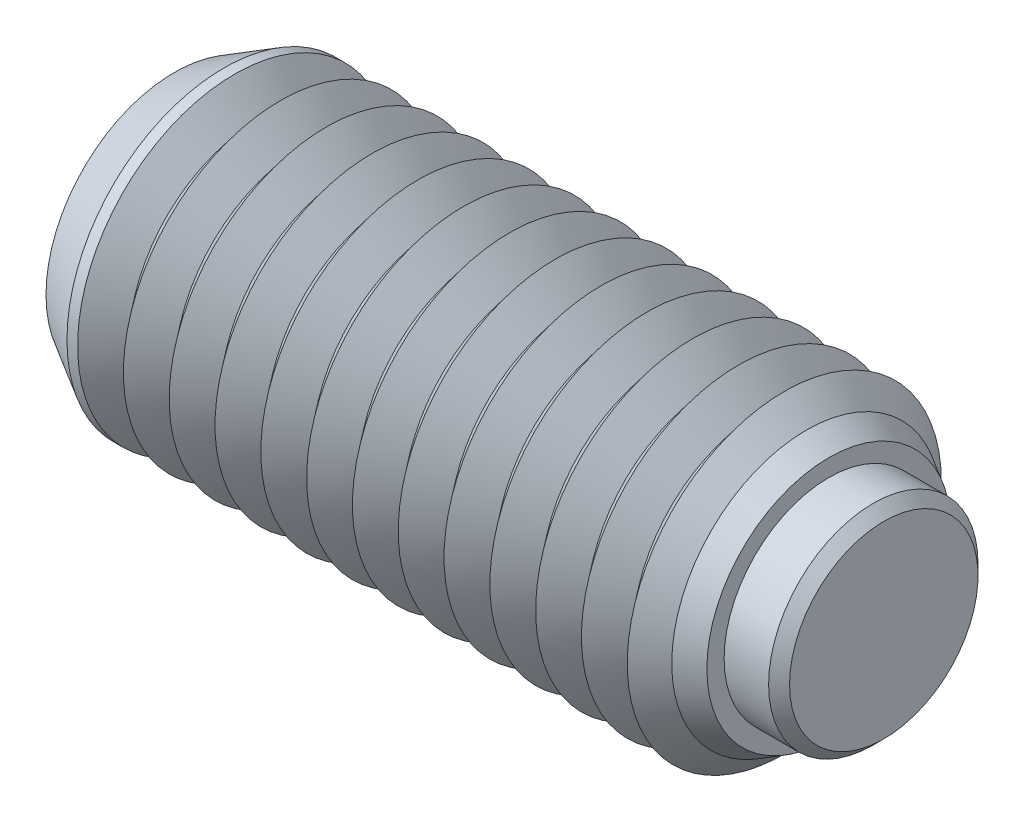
ISO-10303-21;
HEADER;
FILE_DESCRIPTION(('STEP AP214'),'2;1');
FILE_NAME('part.step','',(''),(''),'','','');
FILE_SCHEMA(('AUTOMOTIVE_DESIGN { 1 0 10303 214 1 1 1 1 }'));
ENDSEC;
DATA;
#1=APPLICATION_CONTEXT('core data for automotive mechanical design processes');
#2=APPLICATION_PROTOCOL_DEFINITION('international standard','automotive_design',2000,#1);
#3=PRODUCT_CONTEXT('',#1,'mechanical');
#4=PRODUCT('Part','Part','',(#3));
#5=PRODUCT_RELATED_PRODUCT_CATEGORY('part','',(#4));
#6=PRODUCT_DEFINITION_FORMATION('','',#4);
#7=PRODUCT_DEFINITION_CONTEXT('part definition',#1,'design');
#8=PRODUCT_DEFINITION('design','',#6,#7);
#9=PRODUCT_DEFINITION_SHAPE('','',#8);
#10=(LENGTH_UNIT() NAMED_UNIT(*) SI_UNIT(.MILLI.,.METRE.));
#11=(NAMED_UNIT(*) PLANE_ANGLE_UNIT() SI_UNIT($,.RADIAN.));
#12=(NAMED_UNIT(*) SI_UNIT($,.STERADIAN.) SOLID_ANGLE_UNIT());
#13=UNCERTAINTY_MEASURE_WITH_UNIT(LENGTH_MEASURE(1.E-05),#10,'distance_accuracy_value','');
#14=(GEOMETRIC_REPRESENTATION_CONTEXT(3) GLOBAL_UNCERTAINTY_ASSIGNED_CONTEXT((#13)) GLOBAL_UNIT_ASSIGNED_CONTEXT((#10,
#11,#12)) REPRESENTATION_CONTEXT('',''));
#15=CARTESIAN_POINT('',(0.,0.,0.));
#16=DIRECTION('',(0.,0.,1.));
#17=DIRECTION('',(1.,0.,0.));
#18=AXIS2_PLACEMENT_3D('',#15,#16,#17);
#19=CARTESIAN_POINT('',(2.95,0.,0.));
#20=DIRECTION('',(-1.,0.,0.));
#21=DIRECTION('',(0.,0.,1.));
#22=AXIS2_PLACEMENT_3D('',#19,#20,#21);
#23=CYLINDRICAL_SURFACE('',#22,4.);
#24=CARTESIAN_POINT('',(2.55,0.,0.));
#25=DIRECTION('',(1.,0.,0.));
#26=DIRECTION('',(0.,0.,-1.));
#27=AXIS2_PLACEMENT_3D('',#24,#25,#26);
#28=CIRCLE('',#27,4.);
#29=CARTESIAN_POINT('',(2.55,0.,4.));
#30=VERTEX_POINT('',#29);
#31=EDGE_CURVE('P0_E10',#30,#30,#28,.F.);
#32=ORIENTED_EDGE('',*,*,#31,.T.);
#33=EDGE_LOOP('',(#32));
#34=FACE_BOUND('',#33,.T.);
#35=CARTESIAN_POINT('',(-1.25,0.,0.));
#36=DIRECTION('',(1.,0.,0.));
#37=DIRECTION('',(0.,0.,-1.));
#38=AXIS2_PLACEMENT_3D('',#35,#36,#37);
#39=CIRCLE('',#38,4.);
#40=CARTESIAN_POINT('',(-1.25,0.,-4.));
#41=VERTEX_POINT('',#40);
#42=EDGE_CURVE('P0_E25',#41,#41,#39,.T.);
#43=ORIENTED_EDGE('',*,*,#42,.T.);
#44=EDGE_LOOP('',(#43));
#45=FACE_BOUND('',#44,.T.);
#46=ADVANCED_FACE('P0_F14',(#34,#45),#23,.T.);
#47=CARTESIAN_POINT('',(2.95,0.,0.));
#48=DIRECTION('',(1.,0.,0.));
#49=DIRECTION('',(0.,0.,-1.));
#50=AXIS2_PLACEMENT_3D('',#47,#48,#49);
#51=PLANE('',#50);
#52=CARTESIAN_POINT('',(2.95,0.,0.));
#53=DIRECTION('',(1.,0.,0.));
#54=DIRECTION('',(0.,0.,-1.));
#55=AXIS2_PLACEMENT_3D('',#52,#53,#54);
#56=CIRCLE('',#55,3.6);
#57=CARTESIAN_POINT('',(2.95,0.,3.6));
#58=VERTEX_POINT('',#57);
#59=EDGE_CURVE('P0_E21',#58,#58,#56,.T.);
#60=ORIENTED_EDGE('',*,*,#59,.T.);
#61=EDGE_LOOP('',(#60));
#62=FACE_BOUND('',#61,.T.);
#63=ADVANCED_FACE('P0_F35',(#62),#51,.T.);
#64=CARTESIAN_POINT('',(-1.25,0.,0.));
#65=DIRECTION('',(1.,0.,0.));
#66=DIRECTION('',(0.,0.,-1.));
#67=AXIS2_PLACEMENT_3D('',#64,#65,#66);
#68=PLANE('',#67);
#69=ORIENTED_EDGE('',*,*,#42,.F.);
#70=EDGE_LOOP('',(#69));
#71=FACE_BOUND('',#70,.T.);
#72=ADVANCED_FACE('P0_F33',(#71),#68,.F.);
#73=CARTESIAN_POINT('',(2.95,0.,0.));
#74=DIRECTION('',(-1.,0.,0.));
#75=DIRECTION('',(0.,0.,1.));
#76=AXIS2_PLACEMENT_3D('',#73,#74,#75);
#77=CONICAL_SURFACE('',#76,3.6,0.785398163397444);
#78=CARTESIAN_POINT('',(2.55,0.,4.));
#79=CARTESIAN_POINT('',(2.55416666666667,0.,3.99583333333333));
#80=CARTESIAN_POINT('',(2.55833333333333,0.,3.99166666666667));
#81=CARTESIAN_POINT('',(2.56666666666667,0.,3.98333333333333));
#82=CARTESIAN_POINT('',(2.57083333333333,0.,3.97916666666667));
#83=CARTESIAN_POINT('',(2.57916666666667,0.,3.97083333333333));
#84=CARTESIAN_POINT('',(2.58333333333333,0.,3.96666666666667));
#85=CARTESIAN_POINT('',(2.59166666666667,0.,3.95833333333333));
#86=CARTESIAN_POINT('',(2.59583333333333,0.,3.95416666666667));
#87=CARTESIAN_POINT('',(2.60416666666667,0.,3.94583333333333));
#88=CARTESIAN_POINT('',(2.60833333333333,0.,3.94166666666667));
#89=CARTESIAN_POINT('',(2.61666666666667,0.,3.93333333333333));
#90=CARTESIAN_POINT('',(2.62083333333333,0.,3.92916666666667));
#91=CARTESIAN_POINT('',(2.62916666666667,0.,3.92083333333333));
#92=CARTESIAN_POINT('',(2.63333333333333,0.,3.91666666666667));
#93=CARTESIAN_POINT('',(2.64166666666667,0.,3.90833333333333));
#94=CARTESIAN_POINT('',(2.64583333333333,0.,3.90416666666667));
#95=CARTESIAN_POINT('',(2.65416666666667,0.,3.89583333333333));
#96=CARTESIAN_POINT('',(2.65833333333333,0.,3.89166666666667));
#97=CARTESIAN_POINT('',(2.66666666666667,0.,3.88333333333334));
#98=CARTESIAN_POINT('',(2.67083333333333,0.,3.87916666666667));
#99=CARTESIAN_POINT('',(2.67916666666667,0.,3.87083333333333));
#100=CARTESIAN_POINT('',(2.68333333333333,0.,3.86666666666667));
#101=CARTESIAN_POINT('',(2.69166666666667,0.,3.85833333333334));
#102=CARTESIAN_POINT('',(2.69583333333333,0.,3.85416666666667));
#103=CARTESIAN_POINT('',(2.70416666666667,0.,3.84583333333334));
#104=CARTESIAN_POINT('',(2.70833333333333,0.,3.84166666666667));
#105=CARTESIAN_POINT('',(2.71666666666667,0.,3.83333333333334));
#106=CARTESIAN_POINT('',(2.72083333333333,0.,3.82916666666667));
#107=CARTESIAN_POINT('',(2.72916666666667,0.,3.82083333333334));
#108=CARTESIAN_POINT('',(2.73333333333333,0.,3.81666666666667));
#109=CARTESIAN_POINT('',(2.74166666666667,0.,3.80833333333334));
#110=CARTESIAN_POINT('',(2.74583333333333,0.,3.80416666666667));
#111=CARTESIAN_POINT('',(2.75416666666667,0.,3.79583333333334));
#112=CARTESIAN_POINT('',(2.75833333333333,0.,3.79166666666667));
#113=CARTESIAN_POINT('',(2.76666666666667,0.,3.78333333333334));
#114=CARTESIAN_POINT('',(2.77083333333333,0.,3.77916666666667));
#115=CARTESIAN_POINT('',(2.77916666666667,0.,3.77083333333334));
#116=CARTESIAN_POINT('',(2.78333333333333,0.,3.76666666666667));
#117=CARTESIAN_POINT('',(2.79166666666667,0.,3.75833333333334));
#118=CARTESIAN_POINT('',(2.79583333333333,0.,3.75416666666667));
#119=CARTESIAN_POINT('',(2.80416666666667,0.,3.74583333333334));
#120=CARTESIAN_POINT('',(2.80833333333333,0.,3.74166666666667));
#121=CARTESIAN_POINT('',(2.81666666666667,0.,3.73333333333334));
#122=CARTESIAN_POINT('',(2.82083333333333,0.,3.72916666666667));
#123=CARTESIAN_POINT('',(2.82916666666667,0.,3.72083333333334));
#124=CARTESIAN_POINT('',(2.83333333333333,0.,3.71666666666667));
#125=CARTESIAN_POINT('',(2.84166666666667,0.,3.70833333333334));
#126=CARTESIAN_POINT('',(2.84583333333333,0.,3.70416666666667));
#127=CARTESIAN_POINT('',(2.85416666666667,0.,3.69583333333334));
#128=CARTESIAN_POINT('',(2.85833333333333,0.,3.69166666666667));
#129=CARTESIAN_POINT('',(2.86666666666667,0.,3.68333333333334));
#130=CARTESIAN_POINT('',(2.87083333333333,0.,3.67916666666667));
#131=CARTESIAN_POINT('',(2.87916666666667,0.,3.67083333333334));
#132=CARTESIAN_POINT('',(2.88333333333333,0.,3.66666666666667));
#133=CARTESIAN_POINT('',(2.89166666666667,0.,3.65833333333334));
#134=CARTESIAN_POINT('',(2.89583333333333,0.,3.65416666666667));
#135=CARTESIAN_POINT('',(2.90416666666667,0.,3.64583333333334));
#136=CARTESIAN_POINT('',(2.90833333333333,0.,3.64166666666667));
#137=CARTESIAN_POINT('',(2.91666666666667,0.,3.63333333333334));
#138=CARTESIAN_POINT('',(2.92083333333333,0.,3.62916666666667));
#139=CARTESIAN_POINT('',(2.92916666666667,0.,3.62083333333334));
#140=CARTESIAN_POINT('',(2.93333333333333,0.,3.61666666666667));
#141=CARTESIAN_POINT('',(2.94166666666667,0.,3.60833333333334));
#142=CARTESIAN_POINT('',(2.94583333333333,0.,3.60416666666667));
#143=CARTESIAN_POINT('',(2.95,0.,3.6));
#144=B_SPLINE_CURVE_WITH_KNOTS('',3,(#78,#79,#80,#81,#82,#83,#84,#85,#86,#87,#88,#89,#90,#91,
#92,#93,#94,#95,#96,#97,#98,#99,#100,#101,#102,#103,#104,#105,#106,#107,#108,#109,#110,#111,
#112,#113,#114,#115,#116,#117,#118,#119,#120,#121,#122,#123,#124,#125,#126,#127,#128,#129,#130,
#131,#132,#133,#134,#135,#136,#137,#138,#139,#140,#141,#142,#143),.UNSPECIFIED.,.F.,.F.,(4,2,2,
2,2,2,2,2,2,2,2,2,2,2,2,2,2,2,2,2,2,2,2,2,2,2,2,2,2,2,2,2,4),(0.,0.0176776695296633,
0.0353553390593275,0.0530330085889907,0.070710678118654,0.0883883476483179,0.106066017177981,
0.123743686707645,0.141421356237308,0.159099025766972,0.176776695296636,0.194454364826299,
0.212132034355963,0.229809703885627,0.24748737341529,0.265165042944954,0.282842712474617,
0.300520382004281,0.318198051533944,0.335875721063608,0.353553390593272,0.371231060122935,
0.388908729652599,0.406586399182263,0.424264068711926,0.44194173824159,0.459619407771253,
0.477297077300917,0.49497474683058,0.512652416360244,0.530330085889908,0.548007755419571,
0.565685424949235),.UNSPECIFIED.);
#145=EDGE_CURVE('P0_BSEAM16',#30,#58,#144,.T.);
#146=ORIENTED_EDGE('',*,*,#31,.F.);
#147=ORIENTED_EDGE('',*,*,#59,.F.);
#148=ORIENTED_EDGE('',*,*,#145,.T.);
#149=ORIENTED_EDGE('',*,*,#145,.F.);
#150=EDGE_LOOP('',(#146,#148,#147,#149));
#151=FACE_BOUND('',#150,.T.);
#152=ADVANCED_FACE('P0_F16',(#151),#77,.T.);
#153=CLOSED_SHELL('',(#46,#63,#72,#152));
#154=MANIFOLD_SOLID_BREP('P0_B1',#153);
#155=CARTESIAN_POINT('',(-24.15,0.,0.));
#156=DIRECTION('',(1.,0.,0.));
#157=DIRECTION('',(0.,0.,-1.));
#158=AXIS2_PLACEMENT_3D('',#155,#156,#157);
#159=CYLINDRICAL_SURFACE('',#158,6.);
#160=CARTESIAN_POINT('',(-21.85,0.,0.));
#161=DIRECTION('',(1.,0.,0.));
#162=DIRECTION('',(0.,0.,-1.));
#163=AXIS2_PLACEMENT_3D('',#160,#161,#162);
#164=CIRCLE('',#163,6.);
#165=CARTESIAN_POINT('',(-21.85,0.,-6.));
#166=VERTEX_POINT('',#165);
#167=EDGE_CURVE('P1_E226',#166,#166,#164,.T.);
#168=CARTESIAN_POINT('',(-22.2570855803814,0.,0.));
#169=DIRECTION('',(1.,0.,0.));
#170=DIRECTION('',(0.,0.,-1.));
#171=AXIS2_PLACEMENT_3D('',#168,#169,#170);
#172=CIRCLE('',#171,6.);
#173=CARTESIAN_POINT('',(-22.2570855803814,0.,-6.));
#174=VERTEX_POINT('',#173);
#175=EDGE_CURVE('P1_E229',#174,#174,#172,.T.);
#176=CARTESIAN_POINT('',(-21.85,0.,-6.));
#177=CARTESIAN_POINT('',(-21.8542404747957,0.,-6.));
#178=CARTESIAN_POINT('',(-21.8584809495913,0.,-6.));
#179=CARTESIAN_POINT('',(-21.8669618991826,0.,-6.));
#180=CARTESIAN_POINT('',(-21.8712023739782,0.,-6.));
#181=CARTESIAN_POINT('',(-21.8796833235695,0.,-6.));
#182=CARTESIAN_POINT('',(-21.8839237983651,0.,-6.));
#183=CARTESIAN_POINT('',(-21.8924047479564,0.,-6.));
#184=CARTESIAN_POINT('',(-21.896645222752,0.,-6.));
#185=CARTESIAN_POINT('',(-21.9051261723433,0.,-6.));
#186=CARTESIAN_POINT('',(-21.909366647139,0.,-6.));
#187=CARTESIAN_POINT('',(-21.9178475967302,0.,-6.));
#188=CARTESIAN_POINT('',(-21.9220880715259,0.,-6.));
#189=CARTESIAN_POINT('',(-21.9305690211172,0.,-6.));
#190=CARTESIAN_POINT('',(-21.9348094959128,0.,-6.));
#191=CARTESIAN_POINT('',(-21.9432904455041,0.,-6.));
#192=CARTESIAN_POINT('',(-21.9475309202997,0.,-6.));
#193=CARTESIAN_POINT('',(-21.956011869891,0.,-6.));
#194=CARTESIAN_POINT('',(-21.9602523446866,0.,-6.));
#195=CARTESIAN_POINT('',(-21.9687332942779,0.,-6.));
#196=CARTESIAN_POINT('',(-21.9729737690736,0.,-6.));
#197=CARTESIAN_POINT('',(-21.9814547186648,0.,-6.));
#198=CARTESIAN_POINT('',(-21.9856951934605,0.,-6.));
#199=CARTESIAN_POINT('',(-21.9941761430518,0.,-6.));
#200=CARTESIAN_POINT('',(-21.9984166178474,0.,-6.));
#201=CARTESIAN_POINT('',(-22.0068975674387,0.,-6.));
#202=CARTESIAN_POINT('',(-22.0111380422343,0.,-6.));
#203=CARTESIAN_POINT('',(-22.0196189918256,0.,-6.));
#204=CARTESIAN_POINT('',(-22.0238594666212,0.,-6.));
#205=CARTESIAN_POINT('',(-22.0323404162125,0.,-6.));
#206=CARTESIAN_POINT('',(-22.0365808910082,0.,-6.));
#207=CARTESIAN_POINT('',(-22.0450618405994,0.,-6.));
#208=CARTESIAN_POINT('',(-22.0493023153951,0.,-6.));
#209=CARTESIAN_POINT('',(-22.0577832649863,0.,-6.));
#210=CARTESIAN_POINT('',(-22.062023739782,0.,-6.));
#211=CARTESIAN_POINT('',(-22.0705046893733,0.,-6.));
#212=CARTESIAN_POINT('',(-22.0747451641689,0.,-6.));
#213=CARTESIAN_POINT('',(-22.0832261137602,0.,-6.));
#214=CARTESIAN_POINT('',(-22.0874665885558,0.,-6.));
#215=CARTESIAN_POINT('',(-22.0959475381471,0.,-6.));
#216=CARTESIAN_POINT('',(-22.1001880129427,0.,-6.));
#217=CARTESIAN_POINT('',(-22.108668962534,0.,-6.));
#218=CARTESIAN_POINT('',(-22.1129094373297,0.,-6.));
#219=CARTESIAN_POINT('',(-22.1213903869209,0.,-6.));
#220=CARTESIAN_POINT('',(-22.1256308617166,0.,-6.));
#221=CARTESIAN_POINT('',(-22.1341118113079,0.,-6.));
#222=CARTESIAN_POINT('',(-22.1383522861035,0.,-6.));
#223=CARTESIAN_POINT('',(-22.1468332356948,0.,-6.));
#224=CARTESIAN_POINT('',(-22.1510737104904,0.,-6.));
#225=CARTESIAN_POINT('',(-22.1595546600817,0.,-6.));
#226=CARTESIAN_POINT('',(-22.1637951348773,0.,-6.));
#227=CARTESIAN_POINT('',(-22.1722760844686,0.,-6.));
#228=CARTESIAN_POINT('',(-22.1765165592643,0.,-6.));
#229=CARTESIAN_POINT('',(-22.1849975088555,0.,-6.));
#230=CARTESIAN_POINT('',(-22.1892379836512,0.,-6.));
#231=CARTESIAN_POINT('',(-22.1977189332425,0.,-6.));
#232=CARTESIAN_POINT('',(-22.2019594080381,0.,-6.));
#233=CARTESIAN_POINT('',(-22.2104403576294,0.,-6.));
#234=CARTESIAN_POINT('',(-22.214680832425,0.,-6.));
#235=CARTESIAN_POINT('',(-22.2231617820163,0.,-6.));
#236=CARTESIAN_POINT('',(-22.2274022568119,0.,-6.));
#237=CARTESIAN_POINT('',(-22.2358832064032,0.,-6.));
#238=CARTESIAN_POINT('',(-22.2401236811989,0.,-6.));
#239=CARTESIAN_POINT('',(-22.2486046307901,0.,-6.));
#240=CARTESIAN_POINT('',(-22.2528451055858,0.,-6.));
#241=CARTESIAN_POINT('',(-22.2570855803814,0.,-6.));
#242=B_SPLINE_CURVE_WITH_KNOTS('',3,(#176,#177,#178,#179,#180,#181,#182,#183,#184,#185,#186,
#187,#188,#189,#190,#191,#192,#193,#194,#195,#196,#197,#198,#199,#200,#201,#202,#203,#204,#205,
#206,#207,#208,#209,#210,#211,#212,#213,#214,#215,#216,#217,#218,#219,#220,#221,#222,#223,#224,
#225,#226,#227,#228,#229,#230,#231,#232,#233,#234,#235,#236,#237,#238,#239,#240,#241),
.UNSPECIFIED.,.F.,.F.,(4,2,2,2,2,2,2,2,2,2,2,2,2,2,2,2,2,2,2,2,2,2,2,2,2,2,2,2,2,2,2,2,4),(0.,
0.0127214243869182,0.0254428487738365,0.0381642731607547,0.0508856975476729,0.0636071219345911,
0.0763285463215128,0.0890499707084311,0.101771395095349,0.114492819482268,0.127214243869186,
0.139935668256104,0.152657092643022,0.165378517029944,0.178099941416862,0.19082136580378,
0.203542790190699,0.216264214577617,0.228985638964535,0.241707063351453,0.254428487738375,
0.267149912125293,0.279871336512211,0.29259276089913,0.305314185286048,0.318035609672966,
0.330757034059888,0.343478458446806,0.356199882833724,0.368921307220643,0.381642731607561,
0.394364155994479,0.407085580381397),.UNSPECIFIED.);
#243=EDGE_CURVE('P1_BSEAM15',#166,#174,#242,.T.);
#244=ORIENTED_EDGE('',*,*,#167,.F.);
#245=ORIENTED_EDGE('',*,*,#175,.T.);
#246=ORIENTED_EDGE('',*,*,#243,.T.);
#247=ORIENTED_EDGE('',*,*,#243,.F.);
#248=EDGE_LOOP('',(#244,#246,#245,#247));
#249=FACE_BOUND('',#248,.T.);
#250=ADVANCED_FACE('P1_F15',(#249),#159,.T.);
#251=CARTESIAN_POINT('',(-1.72500000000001,0.,0.));
#252=DIRECTION('',(1.,0.,0.));
#253=DIRECTION('',(0.,0.,-1.));
#254=AXIS2_PLACEMENT_3D('',#251,#252,#253);
#255=CONICAL_SURFACE('',#254,4.90712535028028,0.895664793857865);
#256=CARTESIAN_POINT('',(-0.850000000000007,0.,0.));
#257=DIRECTION('',(1.,0.,0.));
#258=DIRECTION('',(0.,0.,-1.));
#259=AXIS2_PLACEMENT_3D('',#256,#257,#258);
#260=CIRCLE('',#259,6.);
#261=CARTESIAN_POINT('',(-0.850000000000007,0.,-6.));
#262=VERTEX_POINT('',#261);
#263=EDGE_CURVE('P1_E284',#262,#262,#260,.T.);
#264=ORIENTED_EDGE('',*,*,#263,.F.);
#265=EDGE_LOOP('',(#264));
#266=FACE_BOUND('',#265,.T.);
#267=CARTESIAN_POINT('',(-1.72500000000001,0.,0.));
#268=DIRECTION('',(1.,0.,0.));
#269=DIRECTION('',(0.,0.,-1.));
#270=AXIS2_PLACEMENT_3D('',#267,#268,#269);
#271=CIRCLE('',#270,4.90712535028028);
#272=CARTESIAN_POINT('',(-1.72500000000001,0.,-4.90712535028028));
#273=VERTEX_POINT('',#272);
#274=EDGE_CURVE('P1_E289',#273,#273,#271,.T.);
#275=ORIENTED_EDGE('',*,*,#274,.T.);
#276=EDGE_LOOP('',(#275));
#277=FACE_BOUND('',#276,.T.);
#278=ADVANCED_FACE('P1_F214',(#266,#277),#255,.T.);
#279=CARTESIAN_POINT('',(-2.60000000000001,0.,0.));
#280=DIRECTION('',(-1.,0.,0.));
#281=DIRECTION('',(0.,0.,1.));
#282=AXIS2_PLACEMENT_3D('',#279,#280,#281);
#283=CONICAL_SURFACE('',#282,6.,0.895664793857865);
#284=ORIENTED_EDGE('',*,*,#274,.F.);
#285=EDGE_LOOP('',(#284));
#286=FACE_BOUND('',#285,.T.);
#287=CARTESIAN_POINT('',(-2.60000000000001,0.,0.));
#288=DIRECTION('',(1.,0.,0.));
#289=DIRECTION('',(0.,0.,-1.));
#290=AXIS2_PLACEMENT_3D('',#287,#288,#289);
#291=CIRCLE('',#290,6.);
#292=CARTESIAN_POINT('',(-2.60000000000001,0.,-6.));
#293=VERTEX_POINT('',#292);
#294=EDGE_CURVE('P1_E292',#293,#293,#291,.T.);
#295=ORIENTED_EDGE('',*,*,#294,.T.);
#296=EDGE_LOOP('',(#295));
#297=FACE_BOUND('',#296,.T.);
#298=ADVANCED_FACE('P1_F220',(#286,#297),#283,.T.);
#299=CARTESIAN_POINT('',(-1.25,0.,0.));
#300=DIRECTION('',(1.,0.,0.));
#301=DIRECTION('',(0.,1.,0.));
#302=AXIS2_PLACEMENT_3D('',#299,#300,#301);
#303=PLANE('',#302);
#304=CARTESIAN_POINT('',(-1.25,0.,0.));
#305=DIRECTION('',(1.,0.,0.));
#306=DIRECTION('',(0.,1.,0.));
#307=AXIS2_PLACEMENT_3D('',#304,#305,#306);
#308=CIRCLE('',#307,4.);
#309=CARTESIAN_POINT('',(-1.25,4.,0.));
#310=VERTEX_POINT('',#309);
#311=EDGE_CURVE('P1_E279',#310,#310,#308,.T.);
#312=ORIENTED_EDGE('',*,*,#311,.T.);
#313=EDGE_LOOP('',(#312));
#314=FACE_BOUND('',#313,.T.);
#315=ADVANCED_FACE('P1_F451',(#314),#303,.T.);
#316=CARTESIAN_POINT('',(-1.25,0.,0.));
#317=DIRECTION('',(1.,0.,0.));
#318=DIRECTION('',(0.,1.,0.));
#319=AXIS2_PLACEMENT_3D('',#316,#317,#318);
#320=CYLINDRICAL_SURFACE('',#319,4.);
#321=ORIENTED_EDGE('',*,*,#311,.F.);
#322=EDGE_LOOP('',(#321));
#323=FACE_BOUND('',#322,.T.);
#324=CARTESIAN_POINT('',(0.85,0.,0.));
#325=DIRECTION('',(1.,0.,0.));
#326=DIRECTION('',(0.,1.,0.));
#327=AXIS2_PLACEMENT_3D('',#324,#325,#326);
#328=CIRCLE('',#327,4.);
#329=CARTESIAN_POINT('',(0.85,4.,0.));
#330=VERTEX_POINT('',#329);
#331=EDGE_CURVE('P1_E281',#330,#330,#328,.T.);
#332=ORIENTED_EDGE('',*,*,#331,.T.);
#333=EDGE_LOOP('',(#332));
#334=FACE_BOUND('',#333,.T.);
#335=ADVANCED_FACE('P1_F210',(#323,#334),#320,.F.);
#336=CARTESIAN_POINT('',(0.849999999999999,4.65925227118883,0.));
#337=DIRECTION('',(1.,0.,0.));
#338=DIRECTION('',(0.,1.,0.));
#339=AXIS2_PLACEMENT_3D('',#336,#337,#338);
#340=PLANE('',#339);
#341=ORIENTED_EDGE('',*,*,#331,.F.);
#342=EDGE_LOOP('',(#341));
#343=FACE_BOUND('',#342,.T.);
#344=CARTESIAN_POINT('',(0.85,0.,0.));
#345=DIRECTION('',(1.,0.,0.));
#346=DIRECTION('',(0.,1.,0.));
#347=AXIS2_PLACEMENT_3D('',#344,#345,#346);
#348=CIRCLE('',#347,4.65925227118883);
#349=CARTESIAN_POINT('',(0.849999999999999,4.65925227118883,0.));
#350=VERTEX_POINT('',#349);
#351=EDGE_CURVE('P1_E121',#350,#350,#348,.T.);
#352=ORIENTED_EDGE('',*,*,#351,.T.);
#353=EDGE_LOOP('',(#352));
#354=FACE_BOUND('',#353,.T.);
#355=ADVANCED_FACE('P1_F206',(#343,#354),#340,.T.);
#356=CARTESIAN_POINT('',(0.85,0.,0.));
#357=DIRECTION('',(-1.,0.,0.));
#358=DIRECTION('',(0.,-1.,0.));
#359=AXIS2_PLACEMENT_3D('',#356,#357,#358);
#360=CONICAL_SURFACE('',#359,4.65925227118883,0.523598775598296);
#361=CARTESIAN_POINT('',(0.,0.,0.));
#362=DIRECTION('',(1.,0.,0.));
#363=DIRECTION('',(0.,0.,-1.));
#364=AXIS2_PLACEMENT_3D('',#361,#362,#363);
#365=CIRCLE('',#364,5.15000000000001);
#366=CARTESIAN_POINT('',(0.,0.,-5.15000000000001));
#367=VERTEX_POINT('',#366);
#368=EDGE_CURVE('P1_E236',#367,#367,#365,.T.);
#369=ORIENTED_EDGE('',*,*,#368,.T.);
#370=EDGE_LOOP('',(#369));
#371=FACE_BOUND('',#370,.T.);
#372=ORIENTED_EDGE('',*,*,#351,.F.);
#373=EDGE_LOOP('',(#372));
#374=FACE_BOUND('',#373,.T.);
#375=ADVANCED_FACE('P1_F203',(#371,#374),#360,.T.);
#376=CARTESIAN_POINT('',(0.,0.,0.));
#377=DIRECTION('',(-1.,0.,0.));
#378=DIRECTION('',(0.,0.,1.));
#379=AXIS2_PLACEMENT_3D('',#376,#377,#378);
#380=CONICAL_SURFACE('',#379,5.15000000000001,0.785398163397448);
#381=ORIENTED_EDGE('',*,*,#263,.T.);
#382=EDGE_LOOP('',(#381));
#383=FACE_BOUND('',#382,.T.);
#384=ORIENTED_EDGE('',*,*,#368,.F.);
#385=EDGE_LOOP('',(#384));
#386=FACE_BOUND('',#385,.T.);
#387=ADVANCED_FACE('P1_F17',(#383,#386),#380,.T.);
#388=CARTESIAN_POINT('',(-3.47500000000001,0.,0.));
#389=DIRECTION('',(1.,0.,0.));
#390=DIRECTION('',(0.,0.,-1.));
#391=AXIS2_PLACEMENT_3D('',#388,#389,#390);
#392=CONICAL_SURFACE('',#391,4.90712535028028,0.895664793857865);
#393=ORIENTED_EDGE('',*,*,#294,.F.);
#394=EDGE_LOOP('',(#393));
#395=FACE_BOUND('',#394,.T.);
#396=CARTESIAN_POINT('',(-3.47500000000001,0.,0.));
#397=DIRECTION('',(1.,0.,0.));
#398=DIRECTION('',(0.,0.,-1.));
#399=AXIS2_PLACEMENT_3D('',#396,#397,#398);
#400=CIRCLE('',#399,4.90712535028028);
#401=CARTESIAN_POINT('',(-3.47500000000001,0.,-4.90712535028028));
#402=VERTEX_POINT('',#401);
#403=EDGE_CURVE('P1_E295',#402,#402,#400,.T.);
#404=ORIENTED_EDGE('',*,*,#403,.T.);
#405=EDGE_LOOP('',(#404));
#406=FACE_BOUND('',#405,.T.);
#407=ADVANCED_FACE('P1_F445',(#395,#406),#392,.T.);
#408=CARTESIAN_POINT('',(-4.35000000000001,0.,0.));
#409=DIRECTION('',(-1.,0.,0.));
#410=DIRECTION('',(0.,0.,1.));
#411=AXIS2_PLACEMENT_3D('',#408,#409,#410);
#412=CONICAL_SURFACE('',#411,6.,0.895664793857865);
#413=ORIENTED_EDGE('',*,*,#403,.F.);
#414=EDGE_LOOP('',(#413));
#415=FACE_BOUND('',#414,.T.);
#416=CARTESIAN_POINT('',(-4.35000000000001,0.,0.));
#417=DIRECTION('',(1.,0.,0.));
#418=DIRECTION('',(0.,0.,-1.));
#419=AXIS2_PLACEMENT_3D('',#416,#417,#418);
#420=CIRCLE('',#419,6.);
#421=CARTESIAN_POINT('',(-4.35000000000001,0.,-6.));
#422=VERTEX_POINT('',#421);
#423=EDGE_CURVE('P1_E298',#422,#422,#420,.T.);
#424=ORIENTED_EDGE('',*,*,#423,.T.);
#425=EDGE_LOOP('',(#424));
#426=FACE_BOUND('',#425,.T.);
#427=ADVANCED_FACE('P1_F441',(#415,#426),#412,.T.);
#428=CARTESIAN_POINT('',(-5.22500000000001,0.,0.));
#429=DIRECTION('',(1.,0.,0.));
#430=DIRECTION('',(0.,0.,-1.));
#431=AXIS2_PLACEMENT_3D('',#428,#429,#430);
#432=CONICAL_SURFACE('',#431,4.90712535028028,0.895664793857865);
#433=ORIENTED_EDGE('',*,*,#423,.F.);
#434=EDGE_LOOP('',(#433));
#435=FACE_BOUND('',#434,.T.);
#436=CARTESIAN_POINT('',(-5.22500000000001,0.,0.));
#437=DIRECTION('',(1.,0.,0.));
#438=DIRECTION('',(0.,0.,-1.));
#439=AXIS2_PLACEMENT_3D('',#436,#437,#438);
#440=CIRCLE('',#439,4.90712535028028);
#441=CARTESIAN_POINT('',(-5.22500000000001,0.,-4.90712535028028));
#442=VERTEX_POINT('',#441);
#443=EDGE_CURVE('P1_E301',#442,#442,#440,.T.);
#444=ORIENTED_EDGE('',*,*,#443,.T.);
#445=EDGE_LOOP('',(#444));
#446=FACE_BOUND('',#445,.T.);
#447=ADVANCED_FACE('P1_F437',(#435,#446),#432,.T.);
#448=CARTESIAN_POINT('',(-6.10000000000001,0.,0.));
#449=DIRECTION('',(-1.,0.,0.));
#450=DIRECTION('',(0.,0.,1.));
#451=AXIS2_PLACEMENT_3D('',#448,#449,#450);
#452=CONICAL_SURFACE('',#451,6.,0.895664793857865);
#453=ORIENTED_EDGE('',*,*,#443,.F.);
#454=EDGE_LOOP('',(#453));
#455=FACE_BOUND('',#454,.T.);
#456=CARTESIAN_POINT('',(-6.10000000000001,0.,0.));
#457=DIRECTION('',(1.,0.,0.));
#458=DIRECTION('',(0.,0.,-1.));
#459=AXIS2_PLACEMENT_3D('',#456,#457,#458);
#460=CIRCLE('',#459,6.);
#461=CARTESIAN_POINT('',(-6.10000000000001,0.,-6.));
#462=VERTEX_POINT('',#461);
#463=EDGE_CURVE('P1_E304',#462,#462,#460,.T.);
#464=ORIENTED_EDGE('',*,*,#463,.T.);
#465=EDGE_LOOP('',(#464));
#466=FACE_BOUND('',#465,.T.);
#467=ADVANCED_FACE('P1_F433',(#455,#466),#452,.T.);
#468=CARTESIAN_POINT('',(-6.97500000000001,0.,0.));
#469=DIRECTION('',(1.,0.,0.));
#470=DIRECTION('',(0.,0.,-1.));
#471=AXIS2_PLACEMENT_3D('',#468,#469,#470);
#472=CONICAL_SURFACE('',#471,4.90712535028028,0.895664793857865);
#473=ORIENTED_EDGE('',*,*,#463,.F.);
#474=EDGE_LOOP('',(#473));
#475=FACE_BOUND('',#474,.T.);
#476=CARTESIAN_POINT('',(-6.97500000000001,0.,0.));
#477=DIRECTION('',(1.,0.,0.));
#478=DIRECTION('',(0.,0.,-1.));
#479=AXIS2_PLACEMENT_3D('',#476,#477,#478);
#480=CIRCLE('',#479,4.90712535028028);
#481=CARTESIAN_POINT('',(-6.97500000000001,0.,-4.90712535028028));
#482=VERTEX_POINT('',#481);
#483=EDGE_CURVE('P1_E307',#482,#482,#480,.T.);
#484=ORIENTED_EDGE('',*,*,#483,.T.);
#485=EDGE_LOOP('',(#484));
#486=FACE_BOUND('',#485,.T.);
#487=ADVANCED_FACE('P1_F429',(#475,#486),#472,.T.);
#488=CARTESIAN_POINT('',(-7.85000000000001,0.,0.));
#489=DIRECTION('',(-1.,0.,0.));
#490=DIRECTION('',(0.,0.,1.));
#491=AXIS2_PLACEMENT_3D('',#488,#489,#490);
#492=CONICAL_SURFACE('',#491,6.,0.895664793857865);
#493=ORIENTED_EDGE('',*,*,#483,.F.);
#494=EDGE_LOOP('',(#493));
#495=FACE_BOUND('',#494,.T.);
#496=CARTESIAN_POINT('',(-7.85000000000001,0.,0.));
#497=DIRECTION('',(1.,0.,0.));
#498=DIRECTION('',(0.,0.,-1.));
#499=AXIS2_PLACEMENT_3D('',#496,#497,#498);
#500=CIRCLE('',#499,6.);
#501=CARTESIAN_POINT('',(-7.85000000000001,0.,-6.));
#502=VERTEX_POINT('',#501);
#503=EDGE_CURVE('P1_E310',#502,#502,#500,.T.);
#504=ORIENTED_EDGE('',*,*,#503,.T.);
#505=EDGE_LOOP('',(#504));
#506=FACE_BOUND('',#505,.T.);
#507=ADVANCED_FACE('P1_F425',(#495,#506),#492,.T.);
#508=CARTESIAN_POINT('',(-8.72500000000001,0.,0.));
#509=DIRECTION('',(1.,0.,0.));
#510=DIRECTION('',(0.,0.,-1.));
#511=AXIS2_PLACEMENT_3D('',#508,#509,#510);
#512=CONICAL_SURFACE('',#511,4.90712535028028,0.895664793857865);
#513=ORIENTED_EDGE('',*,*,#503,.F.);
#514=EDGE_LOOP('',(#513));
#515=FACE_BOUND('',#514,.T.);
#516=CARTESIAN_POINT('',(-8.72500000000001,0.,0.));
#517=DIRECTION('',(1.,0.,0.));
#518=DIRECTION('',(0.,0.,-1.));
#519=AXIS2_PLACEMENT_3D('',#516,#517,#518);
#520=CIRCLE('',#519,4.90712535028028);
#521=CARTESIAN_POINT('',(-8.72500000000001,0.,-4.90712535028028));
#522=VERTEX_POINT('',#521);
#523=EDGE_CURVE('P1_E313',#522,#522,#520,.T.);
#524=ORIENTED_EDGE('',*,*,#523,.T.);
#525=EDGE_LOOP('',(#524));
#526=FACE_BOUND('',#525,.T.);
#527=ADVANCED_FACE('P1_F421',(#515,#526),#512,.T.);
#528=CARTESIAN_POINT('',(-9.60000000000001,0.,0.));
#529=DIRECTION('',(-1.,0.,0.));
#530=DIRECTION('',(0.,0.,1.));
#531=AXIS2_PLACEMENT_3D('',#528,#529,#530);
#532=CONICAL_SURFACE('',#531,6.,0.895664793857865);
#533=ORIENTED_EDGE('',*,*,#523,.F.);
#534=EDGE_LOOP('',(#533));
#535=FACE_BOUND('',#534,.T.);
#536=CARTESIAN_POINT('',(-9.60000000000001,0.,0.));
#537=DIRECTION('',(1.,0.,0.));
#538=DIRECTION('',(0.,0.,-1.));
#539=AXIS2_PLACEMENT_3D('',#536,#537,#538);
#540=CIRCLE('',#539,6.);
#541=CARTESIAN_POINT('',(-9.60000000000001,0.,-6.));
#542=VERTEX_POINT('',#541);
#543=EDGE_CURVE('P1_E316',#542,#542,#540,.T.);
#544=ORIENTED_EDGE('',*,*,#543,.T.);
#545=EDGE_LOOP('',(#544));
#546=FACE_BOUND('',#545,.T.);
#547=ADVANCED_FACE('P1_F417',(#535,#546),#532,.T.);
#548=CARTESIAN_POINT('',(-10.475,0.,0.));
#549=DIRECTION('',(1.,0.,0.));
#550=DIRECTION('',(0.,0.,-1.));
#551=AXIS2_PLACEMENT_3D('',#548,#549,#550);
#552=CONICAL_SURFACE('',#551,4.90712535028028,0.895664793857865);
#553=ORIENTED_EDGE('',*,*,#543,.F.);
#554=EDGE_LOOP('',(#553));
#555=FACE_BOUND('',#554,.T.);
#556=CARTESIAN_POINT('',(-10.475,0.,0.));
#557=DIRECTION('',(1.,0.,0.));
#558=DIRECTION('',(0.,0.,-1.));
#559=AXIS2_PLACEMENT_3D('',#556,#557,#558);
#560=CIRCLE('',#559,4.90712535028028);
#561=CARTESIAN_POINT('',(-10.475,0.,-4.90712535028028));
#562=VERTEX_POINT('',#561);
#563=EDGE_CURVE('P1_E319',#562,#562,#560,.T.);
#564=ORIENTED_EDGE('',*,*,#563,.T.);
#565=EDGE_LOOP('',(#564));
#566=FACE_BOUND('',#565,.T.);
#567=ADVANCED_FACE('P1_F413',(#555,#566),#552,.T.);
#568=CARTESIAN_POINT('',(-11.35,0.,0.));
#569=DIRECTION('',(-1.,0.,0.));
#570=DIRECTION('',(0.,0.,1.));
#571=AXIS2_PLACEMENT_3D('',#568,#569,#570);
#572=CONICAL_SURFACE('',#571,6.,0.895664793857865);
#573=ORIENTED_EDGE('',*,*,#563,.F.);
#574=EDGE_LOOP('',(#573));
#575=FACE_BOUND('',#574,.T.);
#576=CARTESIAN_POINT('',(-11.35,0.,0.));
#577=DIRECTION('',(1.,0.,0.));
#578=DIRECTION('',(0.,0.,-1.));
#579=AXIS2_PLACEMENT_3D('',#576,#577,#578);
#580=CIRCLE('',#579,6.);
#581=CARTESIAN_POINT('',(-11.35,0.,-6.));
#582=VERTEX_POINT('',#581);
#583=EDGE_CURVE('P1_E322',#582,#582,#580,.T.);
#584=ORIENTED_EDGE('',*,*,#583,.T.);
#585=EDGE_LOOP('',(#584));
#586=FACE_BOUND('',#585,.T.);
#587=ADVANCED_FACE('P1_F409',(#575,#586),#572,.T.);
#588=CARTESIAN_POINT('',(-12.225,0.,0.));
#589=DIRECTION('',(1.,0.,0.));
#590=DIRECTION('',(0.,0.,-1.));
#591=AXIS2_PLACEMENT_3D('',#588,#589,#590);
#592=CONICAL_SURFACE('',#591,4.90712535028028,0.895664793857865);
#593=ORIENTED_EDGE('',*,*,#583,.F.);
#594=EDGE_LOOP('',(#593));
#595=FACE_BOUND('',#594,.T.);
#596=CARTESIAN_POINT('',(-12.225,0.,0.));
#597=DIRECTION('',(1.,0.,0.));
#598=DIRECTION('',(0.,0.,-1.));
#599=AXIS2_PLACEMENT_3D('',#596,#597,#598);
#600=CIRCLE('',#599,4.90712535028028);
#601=CARTESIAN_POINT('',(-12.225,0.,-4.90712535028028));
#602=VERTEX_POINT('',#601);
#603=EDGE_CURVE('P1_E325',#602,#602,#600,.T.);
#604=ORIENTED_EDGE('',*,*,#603,.T.);
#605=EDGE_LOOP('',(#604));
#606=FACE_BOUND('',#605,.T.);
#607=ADVANCED_FACE('P1_F405',(#595,#606),#592,.T.);
#608=CARTESIAN_POINT('',(-13.1,0.,0.));
#609=DIRECTION('',(-1.,0.,0.));
#610=DIRECTION('',(0.,0.,1.));
#611=AXIS2_PLACEMENT_3D('',#608,#609,#610);
#612=CONICAL_SURFACE('',#611,6.,0.895664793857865);
#613=ORIENTED_EDGE('',*,*,#603,.F.);
#614=EDGE_LOOP('',(#613));
#615=FACE_BOUND('',#614,.T.);
#616=CARTESIAN_POINT('',(-13.1,0.,0.));
#617=DIRECTION('',(1.,0.,0.));
#618=DIRECTION('',(0.,0.,-1.));
#619=AXIS2_PLACEMENT_3D('',#616,#617,#618);
#620=CIRCLE('',#619,6.);
#621=CARTESIAN_POINT('',(-13.1,0.,-6.));
#622=VERTEX_POINT('',#621);
#623=EDGE_CURVE('P1_E328',#622,#622,#620,.T.);
#624=ORIENTED_EDGE('',*,*,#623,.T.);
#625=EDGE_LOOP('',(#624));
#626=FACE_BOUND('',#625,.T.);
#627=ADVANCED_FACE('P1_F401',(#615,#626),#612,.T.);
#628=CARTESIAN_POINT('',(-13.975,0.,0.));
#629=DIRECTION('',(1.,0.,0.));
#630=DIRECTION('',(0.,0.,-1.));
#631=AXIS2_PLACEMENT_3D('',#628,#629,#630);
#632=CONICAL_SURFACE('',#631,4.90712535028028,0.895664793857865);
#633=ORIENTED_EDGE('',*,*,#623,.F.);
#634=EDGE_LOOP('',(#633));
#635=FACE_BOUND('',#634,.T.);
#636=CARTESIAN_POINT('',(-13.975,0.,0.));
#637=DIRECTION('',(1.,0.,0.));
#638=DIRECTION('',(0.,0.,-1.));
#639=AXIS2_PLACEMENT_3D('',#636,#637,#638);
#640=CIRCLE('',#639,4.90712535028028);
#641=CARTESIAN_POINT('',(-13.975,0.,-4.90712535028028));
#642=VERTEX_POINT('',#641);
#643=EDGE_CURVE('P1_E331',#642,#642,#640,.T.);
#644=ORIENTED_EDGE('',*,*,#643,.T.);
#645=EDGE_LOOP('',(#644));
#646=FACE_BOUND('',#645,.T.);
#647=ADVANCED_FACE('P1_F397',(#635,#646),#632,.T.);
#648=CARTESIAN_POINT('',(-14.85,0.,0.));
#649=DIRECTION('',(-1.,0.,0.));
#650=DIRECTION('',(0.,0.,1.));
#651=AXIS2_PLACEMENT_3D('',#648,#649,#650);
#652=CONICAL_SURFACE('',#651,6.,0.895664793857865);
#653=ORIENTED_EDGE('',*,*,#643,.F.);
#654=EDGE_LOOP('',(#653));
#655=FACE_BOUND('',#654,.T.);
#656=CARTESIAN_POINT('',(-14.85,0.,0.));
#657=DIRECTION('',(1.,0.,0.));
#658=DIRECTION('',(0.,0.,-1.));
#659=AXIS2_PLACEMENT_3D('',#656,#657,#658);
#660=CIRCLE('',#659,6.);
#661=CARTESIAN_POINT('',(-14.85,0.,-6.));
#662=VERTEX_POINT('',#661);
#663=EDGE_CURVE('P1_E334',#662,#662,#660,.T.);
#664=ORIENTED_EDGE('',*,*,#663,.T.);
#665=EDGE_LOOP('',(#664));
#666=FACE_BOUND('',#665,.T.);
#667=ADVANCED_FACE('P1_F393',(#655,#666),#652,.T.);
#668=CARTESIAN_POINT('',(-15.725,0.,0.));
#669=DIRECTION('',(1.,0.,0.));
#670=DIRECTION('',(0.,0.,-1.));
#671=AXIS2_PLACEMENT_3D('',#668,#669,#670);
#672=CONICAL_SURFACE('',#671,4.90712535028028,0.895664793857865);
#673=ORIENTED_EDGE('',*,*,#663,.F.);
#674=EDGE_LOOP('',(#673));
#675=FACE_BOUND('',#674,.T.);
#676=CARTESIAN_POINT('',(-15.725,0.,0.));
#677=DIRECTION('',(1.,0.,0.));
#678=DIRECTION('',(0.,0.,-1.));
#679=AXIS2_PLACEMENT_3D('',#676,#677,#678);
#680=CIRCLE('',#679,4.90712535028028);
#681=CARTESIAN_POINT('',(-15.725,0.,-4.90712535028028));
#682=VERTEX_POINT('',#681);
#683=EDGE_CURVE('P1_E337',#682,#682,#680,.T.);
#684=ORIENTED_EDGE('',*,*,#683,.T.);
#685=EDGE_LOOP('',(#684));
#686=FACE_BOUND('',#685,.T.);
#687=ADVANCED_FACE('P1_F389',(#675,#686),#672,.T.);
#688=CARTESIAN_POINT('',(-16.6,0.,0.));
#689=DIRECTION('',(-1.,0.,0.));
#690=DIRECTION('',(0.,0.,1.));
#691=AXIS2_PLACEMENT_3D('',#688,#689,#690);
#692=CONICAL_SURFACE('',#691,6.,0.895664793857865);
#693=ORIENTED_EDGE('',*,*,#683,.F.);
#694=EDGE_LOOP('',(#693));
#695=FACE_BOUND('',#694,.T.);
#696=CARTESIAN_POINT('',(-16.6,0.,0.));
#697=DIRECTION('',(1.,0.,0.));
#698=DIRECTION('',(0.,0.,-1.));
#699=AXIS2_PLACEMENT_3D('',#696,#697,#698);
#700=CIRCLE('',#699,6.);
#701=CARTESIAN_POINT('',(-16.6,0.,-6.));
#702=VERTEX_POINT('',#701);
#703=EDGE_CURVE('P1_E340',#702,#702,#700,.T.);
#704=ORIENTED_EDGE('',*,*,#703,.T.);
#705=EDGE_LOOP('',(#704));
#706=FACE_BOUND('',#705,.T.);
#707=ADVANCED_FACE('P1_F385',(#695,#706),#692,.T.);
#708=CARTESIAN_POINT('',(-17.475,0.,0.));
#709=DIRECTION('',(1.,0.,0.));
#710=DIRECTION('',(0.,0.,-1.));
#711=AXIS2_PLACEMENT_3D('',#708,#709,#710);
#712=CONICAL_SURFACE('',#711,4.90712535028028,0.895664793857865);
#713=ORIENTED_EDGE('',*,*,#703,.F.);
#714=EDGE_LOOP('',(#713));
#715=FACE_BOUND('',#714,.T.);
#716=CARTESIAN_POINT('',(-17.475,0.,0.));
#717=DIRECTION('',(1.,0.,0.));
#718=DIRECTION('',(0.,0.,-1.));
#719=AXIS2_PLACEMENT_3D('',#716,#717,#718);
#720=CIRCLE('',#719,4.90712535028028);
#721=CARTESIAN_POINT('',(-17.475,0.,-4.90712535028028));
#722=VERTEX_POINT('',#721);
#723=EDGE_CURVE('P1_E343',#722,#722,#720,.T.);
#724=ORIENTED_EDGE('',*,*,#723,.T.);
#725=EDGE_LOOP('',(#724));
#726=FACE_BOUND('',#725,.T.);
#727=ADVANCED_FACE('P1_F381',(#715,#726),#712,.T.);
#728=CARTESIAN_POINT('',(-18.35,0.,0.));
#729=DIRECTION('',(-1.,0.,0.));
#730=DIRECTION('',(0.,0.,1.));
#731=AXIS2_PLACEMENT_3D('',#728,#729,#730);
#732=CONICAL_SURFACE('',#731,6.,0.895664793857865);
#733=ORIENTED_EDGE('',*,*,#723,.F.);
#734=EDGE_LOOP('',(#733));
#735=FACE_BOUND('',#734,.T.);
#736=CARTESIAN_POINT('',(-18.35,0.,0.));
#737=DIRECTION('',(1.,0.,0.));
#738=DIRECTION('',(0.,0.,-1.));
#739=AXIS2_PLACEMENT_3D('',#736,#737,#738);
#740=CIRCLE('',#739,6.);
#741=CARTESIAN_POINT('',(-18.35,0.,-6.));
#742=VERTEX_POINT('',#741);
#743=EDGE_CURVE('P1_E346',#742,#742,#740,.T.);
#744=ORIENTED_EDGE('',*,*,#743,.T.);
#745=EDGE_LOOP('',(#744));
#746=FACE_BOUND('',#745,.T.);
#747=ADVANCED_FACE('P1_F377',(#735,#746),#732,.T.);
#748=CARTESIAN_POINT('',(-19.225,0.,0.));
#749=DIRECTION('',(1.,0.,0.));
#750=DIRECTION('',(0.,0.,-1.));
#751=AXIS2_PLACEMENT_3D('',#748,#749,#750);
#752=CONICAL_SURFACE('',#751,4.90712535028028,0.895664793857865);
#753=ORIENTED_EDGE('',*,*,#743,.F.);
#754=EDGE_LOOP('',(#753));
#755=FACE_BOUND('',#754,.T.);
#756=CARTESIAN_POINT('',(-19.225,0.,0.));
#757=DIRECTION('',(1.,0.,0.));
#758=DIRECTION('',(0.,0.,-1.));
#759=AXIS2_PLACEMENT_3D('',#756,#757,#758);
#760=CIRCLE('',#759,4.90712535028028);
#761=CARTESIAN_POINT('',(-19.225,0.,-4.90712535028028));
#762=VERTEX_POINT('',#761);
#763=EDGE_CURVE('P1_E349',#762,#762,#760,.T.);
#764=ORIENTED_EDGE('',*,*,#763,.T.);
#765=EDGE_LOOP('',(#764));
#766=FACE_BOUND('',#765,.T.);
#767=ADVANCED_FACE('P1_F373',(#755,#766),#752,.T.);
#768=CARTESIAN_POINT('',(-20.1,0.,0.));
#769=DIRECTION('',(-1.,0.,0.));
#770=DIRECTION('',(0.,0.,1.));
#771=AXIS2_PLACEMENT_3D('',#768,#769,#770);
#772=CONICAL_SURFACE('',#771,6.,0.895664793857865);
#773=ORIENTED_EDGE('',*,*,#763,.F.);
#774=EDGE_LOOP('',(#773));
#775=FACE_BOUND('',#774,.T.);
#776=CARTESIAN_POINT('',(-20.1,0.,0.));
#777=DIRECTION('',(1.,0.,0.));
#778=DIRECTION('',(0.,0.,-1.));
#779=AXIS2_PLACEMENT_3D('',#776,#777,#778);
#780=CIRCLE('',#779,6.);
#781=CARTESIAN_POINT('',(-20.1,0.,-6.));
#782=VERTEX_POINT('',#781);
#783=EDGE_CURVE('P1_E352',#782,#782,#780,.T.);
#784=ORIENTED_EDGE('',*,*,#783,.T.);
#785=EDGE_LOOP('',(#784));
#786=FACE_BOUND('',#785,.T.);
#787=ADVANCED_FACE('P1_F367',(#775,#786),#772,.T.);
#788=CARTESIAN_POINT('',(-20.975,0.,0.));
#789=DIRECTION('',(1.,0.,0.));
#790=DIRECTION('',(0.,0.,-1.));
#791=AXIS2_PLACEMENT_3D('',#788,#789,#790);
#792=CONICAL_SURFACE('',#791,4.90712535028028,0.895664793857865);
#793=ORIENTED_EDGE('',*,*,#783,.F.);
#794=EDGE_LOOP('',(#793));
#795=FACE_BOUND('',#794,.T.);
#796=CARTESIAN_POINT('',(-20.975,0.,0.));
#797=DIRECTION('',(1.,0.,0.));
#798=DIRECTION('',(0.,0.,-1.));
#799=AXIS2_PLACEMENT_3D('',#796,#797,#798);
#800=CIRCLE('',#799,4.90712535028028);
#801=CARTESIAN_POINT('',(-20.975,0.,-4.90712535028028));
#802=VERTEX_POINT('',#801);
#803=EDGE_CURVE('P1_E232',#802,#802,#800,.T.);
#804=ORIENTED_EDGE('',*,*,#803,.T.);
#805=EDGE_LOOP('',(#804));
#806=FACE_BOUND('',#805,.T.);
#807=ADVANCED_FACE('P1_F358',(#795,#806),#792,.T.);
#808=CARTESIAN_POINT('',(-21.85,0.,0.));
#809=DIRECTION('',(-1.,0.,0.));
#810=DIRECTION('',(0.,0.,1.));
#811=AXIS2_PLACEMENT_3D('',#808,#809,#810);
#812=CONICAL_SURFACE('',#811,6.,0.895664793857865);
#813=ORIENTED_EDGE('',*,*,#803,.F.);
#814=EDGE_LOOP('',(#813));
#815=FACE_BOUND('',#814,.T.);
#816=ORIENTED_EDGE('',*,*,#167,.T.);
#817=EDGE_LOOP('',(#816));
#818=FACE_BOUND('',#817,.T.);
#819=ADVANCED_FACE('P1_F360',(#815,#818),#812,.T.);
#820=CARTESIAN_POINT('',(-24.15,0.,0.));
#821=DIRECTION('',(1.,0.,0.));
#822=DIRECTION('',(0.,0.,1.));
#823=AXIS2_PLACEMENT_3D('',#820,#821,#822);
#824=CONICAL_SURFACE('',#823,4.90712535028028,0.5235987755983);
#825=ORIENTED_EDGE('',*,*,#175,.F.);
#826=EDGE_LOOP('',(#825));
#827=FACE_BOUND('',#826,.T.);
#828=CARTESIAN_POINT('',(-24.15,0.,0.));
#829=DIRECTION('',(-1.,0.,0.));
#830=DIRECTION('',(0.,0.,1.));
#831=AXIS2_PLACEMENT_3D('',#828,#829,#830);
#832=CIRCLE('',#831,4.90712535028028);
#833=CARTESIAN_POINT('',(-24.15,0.,4.90712535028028));
#834=VERTEX_POINT('',#833);
#835=EDGE_CURVE('P1_E231',#834,#834,#832,.T.);
#836=ORIENTED_EDGE('',*,*,#835,.F.);
#837=EDGE_LOOP('',(#836));
#838=FACE_BOUND('',#837,.T.);
#839=ADVANCED_FACE('P1_F159',(#827,#838),#824,.T.);
#840=CARTESIAN_POINT('',(-24.15,0.,0.));
#841=DIRECTION('',(1.,0.,0.));
#842=DIRECTION('',(0.,0.,-1.));
#843=AXIS2_PLACEMENT_3D('',#840,#841,#842);
#844=PLANE('',#843);
#845=CARTESIAN_POINT('',(-24.15,0.,0.));
#846=DIRECTION('',(1.,0.,0.));
#847=DIRECTION('',(0.,0.,-1.));
#848=AXIS2_PLACEMENT_3D('',#845,#846,#847);
#849=CIRCLE('',#848,3.46410161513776);
#850=CARTESIAN_POINT('',(-24.15,-3.,-1.73205080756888));
#851=VERTEX_POINT('',#850);
#852=CARTESIAN_POINT('',(-24.15,0.,-3.46410161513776));
#853=VERTEX_POINT('',#852);
#854=EDGE_CURVE('P1_E19',#851,#853,#849,.T.);
#855=ORIENTED_EDGE('',*,*,#854,.T.);
#856=CARTESIAN_POINT('',(-24.15,3.,-1.73205080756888));
#857=VERTEX_POINT('',#856);
#858=EDGE_CURVE('P1_E10',#853,#857,#849,.T.);
#859=ORIENTED_EDGE('',*,*,#858,.T.);
#860=CARTESIAN_POINT('',(-24.15,3.,1.73205080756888));
#861=VERTEX_POINT('',#860);
#862=EDGE_CURVE('P1_E24',#857,#861,#849,.T.);
#863=ORIENTED_EDGE('',*,*,#862,.T.);
#864=CARTESIAN_POINT('',(-24.15,0.,0.));
#865=DIRECTION('',(-1.,0.,0.));
#866=DIRECTION('',(0.,0.,1.));
#867=AXIS2_PLACEMENT_3D('',#864,#865,#866);
#868=CIRCLE('',#867,3.46410161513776);
#869=CARTESIAN_POINT('',(-24.15,0.,3.46410161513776));
#870=VERTEX_POINT('',#869);
#871=EDGE_CURVE('P1_E92',#870,#861,#868,.T.);
#872=ORIENTED_EDGE('',*,*,#871,.F.);
#873=CARTESIAN_POINT('',(-24.15,-3.,1.73205080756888));
#874=VERTEX_POINT('',#873);
#875=EDGE_CURVE('P1_E101',#870,#874,#849,.T.);
#876=ORIENTED_EDGE('',*,*,#875,.T.);
#877=EDGE_CURVE('P1_E107',#874,#851,#849,.T.);
#878=ORIENTED_EDGE('',*,*,#877,.T.);
#879=EDGE_LOOP('',(#855,#859,#863,#872,#876,#878));
#880=FACE_BOUND('',#879,.T.);
#881=ORIENTED_EDGE('',*,*,#835,.T.);
#882=EDGE_LOOP('',(#881));
#883=FACE_BOUND('',#882,.T.);
#884=ADVANCED_FACE('P1_F108',(#880,#883),#844,.F.);
#885=CARTESIAN_POINT('',(-24.15,0.,0.));
#886=DIRECTION('',(-1.,0.,0.));
#887=DIRECTION('',(0.,0.,1.));
#888=AXIS2_PLACEMENT_3D('',#885,#886,#887);
#889=CONICAL_SURFACE('',#888,3.46410161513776,1.0471975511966);
#890=ORIENTED_EDGE('',*,*,#854,.F.);
#891=CARTESIAN_POINT('',(-24.1500666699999,0.000199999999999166,-3.46421708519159));
#892=CARTESIAN_POINT('',(-24.1061045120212,-0.131635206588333,-3.38810199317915));
#893=CARTESIAN_POINT('',(-24.0661223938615,-0.26460840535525,-3.31132988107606));
#894=CARTESIAN_POINT('',(-23.9963328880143,-0.532857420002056,-3.15645624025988));
#895=CARTESIAN_POINT('',(-23.9665501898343,-0.668138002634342,-3.078351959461));
#896=CARTESIAN_POINT('',(-23.9201886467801,-0.937022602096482,-2.92311136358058));
#897=CARTESIAN_POINT('',(-23.9033012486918,-1.07058524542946,-2.84599893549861));
#898=CARTESIAN_POINT('',(-23.8831404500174,-1.33833905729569,-2.6914112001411));
#899=CARTESIAN_POINT('',(-23.87985035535,-1.47252925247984,-2.61393645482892));
#900=CARTESIAN_POINT('',(-23.8866913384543,-1.72327559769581,-2.46916798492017));
#901=CARTESIAN_POINT('',(-23.8951427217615,-1.83986926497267,-2.40185259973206));
#902=CARTESIAN_POINT('',(-23.9219297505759,-2.07229698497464,-2.2676603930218));
#903=CARTESIAN_POINT('',(-23.9402745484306,-2.18813023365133,-2.2007840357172));
#904=CARTESIAN_POINT('',(-23.9861355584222,-2.42103725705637,-2.06631510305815));
#905=CARTESIAN_POINT('',(-24.013846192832,-2.53808155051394,-1.99873954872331));
#906=CARTESIAN_POINT('',(-24.0767386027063,-2.77042435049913,-1.86459637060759));
#907=CARTESIAN_POINT('',(-24.1119055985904,-2.88572583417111,-1.79802702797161));
#908=CARTESIAN_POINT('',(-24.1500666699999,-3.0002,-1.73193533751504));
#909=B_SPLINE_CURVE_WITH_KNOTS('',3,(#891,#892,#893,#894,#895,#896,#897,#898,#899,#900,#901,
#902,#903,#904,#905,#906,#907,#908),.UNSPECIFIED.,.F.,.F.,(4,2,2,2,2,2,2,2,4),(0.,
0.47553983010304,0.952222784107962,1.41710776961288,1.88142182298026,2.28572436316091,
2.69040156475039,3.10405572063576,3.5168974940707),.UNSPECIFIED.);
#910=EDGE_CURVE('P1_E130',#853,#851,#909,.T.);
#911=ORIENTED_EDGE('',*,*,#910,.F.);
#912=EDGE_LOOP('',(#890,#911));
#913=FACE_BOUND('',#912,.T.);
#914=ADVANCED_FACE('P1_F158',(#913),#889,.F.);
#915=ORIENTED_EDGE('',*,*,#877,.F.);
#916=CARTESIAN_POINT('',(-25.2655058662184,-3.,-4.48543536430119));
#917=CARTESIAN_POINT('',(-25.2033525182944,-3.,-4.35588503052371));
#918=CARTESIAN_POINT('',(-25.1418447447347,-3.,-4.22601909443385));
#919=CARTESIAN_POINT('',(-25.0204865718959,-3.,-3.96548781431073));
#920=CARTESIAN_POINT('',(-24.9606364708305,-3.,-3.83482233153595));
#921=CARTESIAN_POINT('',(-24.8426255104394,-3.,-3.57177454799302));
#922=CARTESIAN_POINT('',(-24.7844771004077,-3.,-3.43938664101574));
#923=CARTESIAN_POINT('',(-24.670787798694,-3.,-3.1734999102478));
#924=CARTESIAN_POINT('',(-24.6152467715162,-3.,-3.04000114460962));
#925=CARTESIAN_POINT('',(-24.5060522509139,-3.,-2.76816374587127));
#926=CARTESIAN_POINT('',(-24.4524860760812,-3.,-2.62978983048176));
#927=CARTESIAN_POINT('',(-24.3498072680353,-3.,-2.35136827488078));
#928=CARTESIAN_POINT('',(-24.3006951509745,-3.,-2.21132044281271));
#929=CARTESIAN_POINT('',(-24.2083268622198,-3.,-1.92964550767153));
#930=CARTESIAN_POINT('',(-24.1650573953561,-3.,-1.78802281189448));
#931=CARTESIAN_POINT('',(-24.0858603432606,-3.,-1.50276021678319));
#932=CARTESIAN_POINT('',(-24.0499302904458,-3.,-1.35912101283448));
#933=CARTESIAN_POINT('',(-23.9873211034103,-3.,-1.07010604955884));
#934=CARTESIAN_POINT('',(-23.9606233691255,-3.,-0.924734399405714));
#935=CARTESIAN_POINT('',(-23.9182292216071,-3.,-0.632364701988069));
#936=CARTESIAN_POINT('',(-23.9025320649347,-3.,-0.485366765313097));
#937=CARTESIAN_POINT('',(-23.8835954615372,-3.,-0.192319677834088));
#938=CARTESIAN_POINT('',(-23.8802090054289,-3.,-0.046280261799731));
#939=CARTESIAN_POINT('',(-23.8858029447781,-3.,0.24557029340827));
#940=CARTESIAN_POINT('',(-23.8947841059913,-3.,0.391381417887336));
#941=CARTESIAN_POINT('',(-23.9204392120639,-3.,0.643869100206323));
#942=CARTESIAN_POINT('',(-23.9344927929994,-3.,0.750824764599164));
#943=CARTESIAN_POINT('',(-23.968287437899,-3.,0.963840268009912));
#944=CARTESIAN_POINT('',(-23.9880294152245,-3.,1.06989996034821));
#945=CARTESIAN_POINT('',(-24.0547377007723,-3.,1.38665295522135));
#946=CARTESIAN_POINT('',(-24.1091709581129,-3.,1.59578522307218));
#947=CARTESIAN_POINT('',(-24.2021590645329,-3.,1.90847552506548));
#948=CARTESIAN_POINT('',(-24.2354739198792,-3.,2.01368216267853));
#949=CARTESIAN_POINT('',(-24.3052056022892,-3.,2.22307230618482));
#950=CARTESIAN_POINT('',(-24.3416224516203,-3.,2.32725580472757));
#951=CARTESIAN_POINT('',(-24.4170037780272,-3.,2.53464131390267));
#952=CARTESIAN_POINT('',(-24.4559672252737,-3.,2.63784370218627));
#953=CARTESIAN_POINT('',(-24.5360193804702,-3.,2.84341663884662));
#954=CARTESIAN_POINT('',(-24.5771080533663,-3.,2.94578720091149));
#955=CARTESIAN_POINT('',(-24.6846253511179,-3.,3.20710093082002));
#956=CARTESIAN_POINT('',(-24.7523232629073,-3.,3.36552117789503));
#957=CARTESIAN_POINT('',(-24.8909758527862,-3.,3.68093440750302));
#958=CARTESIAN_POINT('',(-24.9619307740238,-3.,3.83792728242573));
#959=CARTESIAN_POINT('',(-25.1063624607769,-3.,4.15079104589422));
#960=CARTESIAN_POINT('',(-25.1798398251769,-3.,4.30666165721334));
#961=CARTESIAN_POINT('',(-25.3287569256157,-3.,4.61746411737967));
#962=CARTESIAN_POINT('',(-25.4041967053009,-3.,4.77239594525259));
#963=CARTESIAN_POINT('',(-25.6330040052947,-3.,5.23641467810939));
#964=CARTESIAN_POINT('',(-25.788687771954,-3.,5.54435835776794));
#965=CARTESIAN_POINT('',(-26.1040341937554,-3.,6.15813200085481));
#966=CARTESIAN_POINT('',(-26.263696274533,-3.,6.46396226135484));
#967=CARTESIAN_POINT('',(-26.5705840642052,-3.,7.04536657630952));
#968=CARTESIAN_POINT('',(-26.7175613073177,-3.,7.32107199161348));
#969=CARTESIAN_POINT('',(-27.0131899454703,-3.,7.87159754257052));
#970=CARTESIAN_POINT('',(-27.1618414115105,-3.,8.14641764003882));
#971=CARTESIAN_POINT('',(-27.4600196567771,-3.,8.6946763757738));
#972=CARTESIAN_POINT('',(-27.609543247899,-3.,8.96811674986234));
#973=CARTESIAN_POINT('',(-27.9095628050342,-3.,9.51444318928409));
#974=CARTESIAN_POINT('',(-28.060058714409,-3.,9.78732928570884));
#975=CARTESIAN_POINT('',(-28.2109113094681,-3.,10.060016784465));
#976=B_SPLINE_CURVE_WITH_KNOTS('',3,(#916,#917,#918,#919,#920,#921,#922,#923,#924,#925,#926,
#927,#928,#929,#930,#931,#932,#933,#934,#935,#936,#937,#938,#939,#940,#941,#942,#943,#944,#945,
#946,#947,#948,#949,#950,#951,#952,#953,#954,#955,#956,#957,#958,#959,#960,#961,#962,#963,#964,
#965,#966,#967,#968,#969,#970,#971,#972,#973,#974,#975),.UNSPECIFIED.,.F.,.F.,(4,2,2,2,2,2,2,2,
2,2,2,2,2,2,2,2,2,2,2,2,2,2,2,2,2,2,2,2,2,4),(0.,0.431071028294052,0.862219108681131,
1.29598254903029,1.72972342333,2.1748047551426,2.61993759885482,3.06403981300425,
3.50799246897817,3.95104542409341,4.39406843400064,4.83178333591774,5.26952534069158,
5.59299045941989,5.91650754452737,6.56394740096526,6.89499029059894,7.22603555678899,
7.55694776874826,7.88785452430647,8.40463803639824,8.92146019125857,9.43840591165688,
9.95536313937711,10.9904914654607,12.0254712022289,12.9627691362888,13.9001069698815,
14.8350606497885,15.7699603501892),.UNSPECIFIED.);
#977=EDGE_CURVE('P1_E128',#851,#874,#976,.T.);
#978=ORIENTED_EDGE('',*,*,#977,.F.);
#979=EDGE_LOOP('',(#915,#978));
#980=FACE_BOUND('',#979,.T.);
#981=ADVANCED_FACE('P1_F503',(#980),#889,.F.);
#982=ORIENTED_EDGE('',*,*,#875,.F.);
#983=CARTESIAN_POINT('',(-24.1500666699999,-3.0002,1.73193533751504));
#984=CARTESIAN_POINT('',(-24.1061045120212,-2.86836479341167,1.80805042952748));
#985=CARTESIAN_POINT('',(-24.0661223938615,-2.73539159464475,1.88482254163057));
#986=CARTESIAN_POINT('',(-23.9963328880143,-2.46714257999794,2.03969618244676));
#987=CARTESIAN_POINT('',(-23.9665501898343,-2.33186199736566,2.11780046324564));
#988=CARTESIAN_POINT('',(-23.9201886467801,-2.06297739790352,2.27304105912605));
#989=CARTESIAN_POINT('',(-23.9033012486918,-1.92941475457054,2.35015348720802));
#990=CARTESIAN_POINT('',(-23.8831404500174,-1.66166094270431,2.50474122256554));
#991=CARTESIAN_POINT('',(-23.87985035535,-1.52747074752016,2.58221596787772));
#992=CARTESIAN_POINT('',(-23.8866913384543,-1.27672440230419,2.72698443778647));
#993=CARTESIAN_POINT('',(-23.8951427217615,-1.16013073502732,2.79429982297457));
#994=CARTESIAN_POINT('',(-23.9219297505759,-0.927703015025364,2.92849202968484));
#995=CARTESIAN_POINT('',(-23.9402745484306,-0.81186976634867,2.99536838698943));
#996=CARTESIAN_POINT('',(-23.9861355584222,-0.578962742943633,3.12983731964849));
#997=CARTESIAN_POINT('',(-24.013846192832,-0.46191844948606,3.19741287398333));
#998=CARTESIAN_POINT('',(-24.0767386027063,-0.229575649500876,3.33155605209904));
#999=CARTESIAN_POINT('',(-24.1119055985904,-0.114274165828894,3.39812539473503));
#1000=CARTESIAN_POINT('',(-24.1500666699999,0.000199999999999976,3.4642170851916));
#1001=B_SPLINE_CURVE_WITH_KNOTS('',3,(#983,#984,#985,#986,#987,#988,#989,#990,#991,#992,#993,
#994,#995,#996,#997,#998,#999,#1000),.UNSPECIFIED.,.F.,.F.,(4,2,2,2,2,2,2,2,4),(0.,
0.475539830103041,0.952222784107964,1.41710776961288,1.88142182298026,2.28572436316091,
2.69040156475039,3.10405572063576,3.5168974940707),.UNSPECIFIED.);
#1002=EDGE_CURVE('P1_E96',#874,#870,#1001,.T.);
#1003=ORIENTED_EDGE('',*,*,#1002,.F.);
#1004=EDGE_LOOP('',(#982,#1003));
#1005=FACE_BOUND('',#1004,.T.);
#1006=ADVANCED_FACE('P1_F102',(#1005),#889,.F.);
#1007=ORIENTED_EDGE('',*,*,#871,.T.);
#1008=CARTESIAN_POINT('',(-24.1500666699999,-0.000199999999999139,3.4642170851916));
#1009=CARTESIAN_POINT('',(-24.1061045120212,0.131635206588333,3.38810199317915));
#1010=CARTESIAN_POINT('',(-24.0661223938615,0.26460840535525,3.31132988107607));
#1011=CARTESIAN_POINT('',(-23.9963328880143,0.532857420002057,3.15645624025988));
#1012=CARTESIAN_POINT('',(-23.9665501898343,0.668138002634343,3.078351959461));
#1013=CARTESIAN_POINT('',(-23.9201886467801,0.937022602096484,2.92311136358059));
#1014=CARTESIAN_POINT('',(-23.9033012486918,1.07058524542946,2.84599893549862));
#1015=CARTESIAN_POINT('',(-23.8831404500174,1.33833905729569,2.6914112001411));
#1016=CARTESIAN_POINT('',(-23.87985035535,1.47252925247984,2.61393645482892));
#1017=CARTESIAN_POINT('',(-23.8866913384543,1.72327559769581,2.46916798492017));
#1018=CARTESIAN_POINT('',(-23.8951427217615,1.83986926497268,2.40185259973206));
#1019=CARTESIAN_POINT('',(-23.9219297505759,2.07229698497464,2.2676603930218));
#1020=CARTESIAN_POINT('',(-23.9402745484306,2.18813023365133,2.2007840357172));
#1021=CARTESIAN_POINT('',(-23.9861355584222,2.42103725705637,2.06631510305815));
#1022=CARTESIAN_POINT('',(-24.013846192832,2.53808155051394,1.99873954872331));
#1023=CARTESIAN_POINT('',(-24.0767386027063,2.77042435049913,1.86459637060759));
#1024=CARTESIAN_POINT('',(-24.1119055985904,2.88572583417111,1.79802702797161));
#1025=CARTESIAN_POINT('',(-24.1500666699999,3.0002,1.73193533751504));
#1026=B_SPLINE_CURVE_WITH_KNOTS('',3,(#1008,#1009,#1010,#1011,#1012,#1013,#1014,#1015,#1016,
#1017,#1018,#1019,#1020,#1021,#1022,#1023,#1024,#1025),.UNSPECIFIED.,.F.,.F.,(4,2,2,2,2,2,2,2,
4),(0.,0.475539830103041,0.952222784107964,1.41710776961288,1.88142182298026,2.28572436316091,
2.69040156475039,3.10405572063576,3.5168974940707),.UNSPECIFIED.);
#1027=EDGE_CURVE('P1_E88',#870,#861,#1026,.T.);
#1028=ORIENTED_EDGE('',*,*,#1027,.F.);
#1029=EDGE_LOOP('',(#1007,#1028));
#1030=FACE_BOUND('',#1029,.T.);
#1031=ADVANCED_FACE('P1_F90',(#1030),#889,.F.);
#1032=ORIENTED_EDGE('',*,*,#862,.F.);
#1033=CARTESIAN_POINT('',(-25.2655058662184,3.,-4.4854353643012));
#1034=CARTESIAN_POINT('',(-25.2033525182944,3.,-4.35588503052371));
#1035=CARTESIAN_POINT('',(-25.1418447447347,3.,-4.22601909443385));
#1036=CARTESIAN_POINT('',(-25.0204865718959,3.,-3.96548781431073));
#1037=CARTESIAN_POINT('',(-24.9606364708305,3.,-3.83482233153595));
#1038=CARTESIAN_POINT('',(-24.8426255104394,3.,-3.57177454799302));
#1039=CARTESIAN_POINT('',(-24.7844771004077,3.,-3.43938664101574));
#1040=CARTESIAN_POINT('',(-24.670787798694,3.,-3.1734999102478));
#1041=CARTESIAN_POINT('',(-24.6152467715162,3.,-3.04000114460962));
#1042=CARTESIAN_POINT('',(-24.5060522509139,3.,-2.76816374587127));
#1043=CARTESIAN_POINT('',(-24.4524860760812,3.,-2.62978983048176));
#1044=CARTESIAN_POINT('',(-24.3498072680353,3.,-2.35136827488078));
#1045=CARTESIAN_POINT('',(-24.3006951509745,3.,-2.21132044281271));
#1046=CARTESIAN_POINT('',(-24.2083268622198,3.,-1.92964550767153));
#1047=CARTESIAN_POINT('',(-24.1650573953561,3.,-1.78802281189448));
#1048=CARTESIAN_POINT('',(-24.0858603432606,3.,-1.50276021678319));
#1049=CARTESIAN_POINT('',(-24.0499302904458,3.,-1.35912101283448));
#1050=CARTESIAN_POINT('',(-23.9873211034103,3.,-1.07010604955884));
#1051=CARTESIAN_POINT('',(-23.9606233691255,3.,-0.924734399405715));
#1052=CARTESIAN_POINT('',(-23.9182292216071,3.,-0.632364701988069));
#1053=CARTESIAN_POINT('',(-23.9025320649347,3.,-0.485366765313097));
#1054=CARTESIAN_POINT('',(-23.8835954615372,3.,-0.192319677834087));
#1055=CARTESIAN_POINT('',(-23.8802090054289,3.,-0.0462802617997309));
#1056=CARTESIAN_POINT('',(-23.8858029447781,3.,0.24557029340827));
#1057=CARTESIAN_POINT('',(-23.8947841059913,3.,0.391381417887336));
#1058=CARTESIAN_POINT('',(-23.9204392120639,3.,0.643869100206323));
#1059=CARTESIAN_POINT('',(-23.9344927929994,3.,0.750824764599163));
#1060=CARTESIAN_POINT('',(-23.968287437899,3.,0.963840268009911));
#1061=CARTESIAN_POINT('',(-23.9880294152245,3.,1.0698999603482));
#1062=CARTESIAN_POINT('',(-24.0547377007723,3.,1.38665295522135));
#1063=CARTESIAN_POINT('',(-24.1091709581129,3.,1.59578522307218));
#1064=CARTESIAN_POINT('',(-24.2021590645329,3.,1.90847552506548));
#1065=CARTESIAN_POINT('',(-24.2354739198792,3.,2.01368216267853));
#1066=CARTESIAN_POINT('',(-24.3052056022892,3.,2.22307230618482));
#1067=CARTESIAN_POINT('',(-24.3416224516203,3.,2.32725580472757));
#1068=CARTESIAN_POINT('',(-24.4170037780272,3.,2.53464131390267));
#1069=CARTESIAN_POINT('',(-24.4559672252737,3.,2.63784370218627));
#1070=CARTESIAN_POINT('',(-24.5360193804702,3.,2.84341663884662));
#1071=CARTESIAN_POINT('',(-24.5771080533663,3.,2.94578720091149));
#1072=CARTESIAN_POINT('',(-24.6846253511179,3.,3.20710093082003));
#1073=CARTESIAN_POINT('',(-24.7523232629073,3.,3.36552117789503));
#1074=CARTESIAN_POINT('',(-24.8909758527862,3.,3.68093440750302));
#1075=CARTESIAN_POINT('',(-24.9619307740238,3.,3.83792728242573));
#1076=CARTESIAN_POINT('',(-25.1063624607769,3.,4.15079104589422));
#1077=CARTESIAN_POINT('',(-25.1798398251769,3.,4.30666165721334));
#1078=CARTESIAN_POINT('',(-25.3287569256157,3.,4.61746411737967));
#1079=CARTESIAN_POINT('',(-25.404196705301,3.,4.77239594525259));
#1080=CARTESIAN_POINT('',(-25.6330040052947,3.,5.23641467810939));
#1081=CARTESIAN_POINT('',(-25.788687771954,3.,5.54435835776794));
#1082=CARTESIAN_POINT('',(-26.1040341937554,3.,6.15813200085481));
#1083=CARTESIAN_POINT('',(-26.263696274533,3.,6.46396226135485));
#1084=CARTESIAN_POINT('',(-26.5705840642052,3.,7.04536657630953));
#1085=CARTESIAN_POINT('',(-26.7175613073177,3.,7.32107199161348));
#1086=CARTESIAN_POINT('',(-27.0131899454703,3.,7.87159754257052));
#1087=CARTESIAN_POINT('',(-27.1618414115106,3.,8.14641764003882));
#1088=CARTESIAN_POINT('',(-27.4600196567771,3.,8.6946763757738));
#1089=CARTESIAN_POINT('',(-27.609543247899,3.,8.96811674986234));
#1090=CARTESIAN_POINT('',(-27.9095628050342,3.,9.5144431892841));
#1091=CARTESIAN_POINT('',(-28.060058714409,3.,9.78732928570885));
#1092=CARTESIAN_POINT('',(-28.2109113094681,3.,10.060016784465));
#1093=B_SPLINE_CURVE_WITH_KNOTS('',3,(#1033,#1034,#1035,#1036,#1037,#1038,#1039,#1040,#1041,
#1042,#1043,#1044,#1045,#1046,#1047,#1048,#1049,#1050,#1051,#1052,#1053,#1054,#1055,#1056,#1057,
#1058,#1059,#1060,#1061,#1062,#1063,#1064,#1065,#1066,#1067,#1068,#1069,#1070,#1071,#1072,#1073,
#1074,#1075,#1076,#1077,#1078,#1079,#1080,#1081,#1082,#1083,#1084,#1085,#1086,#1087,#1088,#1089,
#1090,#1091,#1092),.UNSPECIFIED.,.F.,.F.,(4,2,2,2,2,2,2,2,2,2,2,2,2,2,2,2,2,2,2,2,2,2,2,2,2,2,2,
2,2,4),(0.,0.431071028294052,0.862219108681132,1.2959825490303,1.72972342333,2.1748047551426,
2.61993759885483,3.06403981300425,3.50799246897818,3.95104542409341,4.39406843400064,
4.83178333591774,5.26952534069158,5.59299045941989,5.91650754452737,6.56394740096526,
6.89499029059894,7.226035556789,7.55694776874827,7.88785452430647,8.40463803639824,
8.92146019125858,9.43840591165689,9.95536313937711,10.9904914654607,12.0254712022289,
12.9627691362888,13.9001069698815,14.8350606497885,15.7699603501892),.UNSPECIFIED.);
#1094=EDGE_CURVE('P1_E97',#861,#857,#1093,.F.);
#1095=ORIENTED_EDGE('',*,*,#1094,.F.);
#1096=EDGE_LOOP('',(#1032,#1095));
#1097=FACE_BOUND('',#1096,.T.);
#1098=ADVANCED_FACE('P1_F157',(#1097),#889,.F.);
#1099=ORIENTED_EDGE('',*,*,#858,.F.);
#1100=CARTESIAN_POINT('',(-24.1500666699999,3.0002,-1.73193533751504));
#1101=CARTESIAN_POINT('',(-24.1061045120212,2.86836479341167,-1.80805042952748));
#1102=CARTESIAN_POINT('',(-24.0661223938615,2.73539159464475,-1.88482254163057));
#1103=CARTESIAN_POINT('',(-23.9963328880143,2.46714257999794,-2.03969618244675));
#1104=CARTESIAN_POINT('',(-23.9665501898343,2.33186199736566,-2.11780046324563));
#1105=CARTESIAN_POINT('',(-23.9201886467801,2.06297739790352,-2.27304105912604));
#1106=CARTESIAN_POINT('',(-23.9033012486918,1.92941475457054,-2.35015348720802));
#1107=CARTESIAN_POINT('',(-23.8831404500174,1.66166094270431,-2.50474122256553));
#1108=CARTESIAN_POINT('',(-23.87985035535,1.52747074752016,-2.58221596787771));
#1109=CARTESIAN_POINT('',(-23.8866913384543,1.27672440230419,-2.72698443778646));
#1110=CARTESIAN_POINT('',(-23.8951427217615,1.16013073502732,-2.79429982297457));
#1111=CARTESIAN_POINT('',(-23.9219297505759,0.927703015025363,-2.92849202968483));
#1112=CARTESIAN_POINT('',(-23.9402745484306,0.811869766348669,-2.99536838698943));
#1113=CARTESIAN_POINT('',(-23.9861355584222,0.578962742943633,-3.12983731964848));
#1114=CARTESIAN_POINT('',(-24.013846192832,0.46191844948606,-3.19741287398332));
#1115=CARTESIAN_POINT('',(-24.0767386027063,0.229575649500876,-3.33155605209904));
#1116=CARTESIAN_POINT('',(-24.1119055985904,0.114274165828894,-3.39812539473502));
#1117=CARTESIAN_POINT('',(-24.1500666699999,-0.000199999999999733,-3.46421708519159));
#1118=B_SPLINE_CURVE_WITH_KNOTS('',3,(#1100,#1101,#1102,#1103,#1104,#1105,#1106,#1107,#1108,
#1109,#1110,#1111,#1112,#1113,#1114,#1115,#1116,#1117),.UNSPECIFIED.,.F.,.F.,(4,2,2,2,2,2,2,2,
4),(0.,0.475539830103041,0.952222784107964,1.41710776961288,1.88142182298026,2.28572436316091,
2.69040156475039,3.10405572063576,3.5168974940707),.UNSPECIFIED.);
#1119=EDGE_CURVE('P1_E178',#857,#853,#1118,.T.);
#1120=ORIENTED_EDGE('',*,*,#1119,.F.);
#1121=EDGE_LOOP('',(#1099,#1120));
#1122=FACE_BOUND('',#1121,.T.);
#1123=ADVANCED_FACE('P1_F152',(#1122),#889,.F.);
#1124=CARTESIAN_POINT('',(-16.4179491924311,0.,0.));
#1125=DIRECTION('',(-1.,0.,0.));
#1126=DIRECTION('',(0.,-1.,0.));
#1127=AXIS2_PLACEMENT_3D('',#1124,#1125,#1126);
#1128=CONICAL_SURFACE('',#1127,0.,1.0471975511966);
#1129=CARTESIAN_POINT('',(-18.15,0.,0.));
#1130=DIRECTION('',(1.,0.,0.));
#1131=DIRECTION('',(0.,1.,0.));
#1132=AXIS2_PLACEMENT_3D('',#1129,#1130,#1131);
#1133=CIRCLE('',#1132,3.);
#1134=CARTESIAN_POINT('',(-18.15,3.,0.));
#1135=VERTEX_POINT('',#1134);
#1136=CARTESIAN_POINT('',(-18.15,1.5,2.59807621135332));
#1137=VERTEX_POINT('',#1136);
#1138=EDGE_CURVE('P1_E276',#1135,#1137,#1133,.T.);
#1139=ORIENTED_EDGE('',*,*,#1138,.F.);
#1140=CARTESIAN_POINT('',(-18.15,1.5,-2.59807621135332));
#1141=VERTEX_POINT('',#1140);
#1142=EDGE_CURVE('P1_E239',#1141,#1135,#1133,.T.);
#1143=ORIENTED_EDGE('',*,*,#1142,.F.);
#1144=CARTESIAN_POINT('',(-18.15,-1.5,-2.59807621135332));
#1145=VERTEX_POINT('',#1144);
#1146=EDGE_CURVE('P1_E481',#1145,#1141,#1133,.T.);
#1147=ORIENTED_EDGE('',*,*,#1146,.F.);
#1148=CARTESIAN_POINT('',(-18.15,-3.,0.));
#1149=VERTEX_POINT('',#1148);
#1150=EDGE_CURVE('P1_E482',#1149,#1145,#1133,.T.);
#1151=ORIENTED_EDGE('',*,*,#1150,.F.);
#1152=CARTESIAN_POINT('',(-18.15,-1.5,2.59807621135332));
#1153=VERTEX_POINT('',#1152);
#1154=EDGE_CURVE('P1_E486',#1153,#1149,#1133,.T.);
#1155=ORIENTED_EDGE('',*,*,#1154,.F.);
#1156=EDGE_CURVE('P1_E280',#1137,#1153,#1133,.T.);
#1157=ORIENTED_EDGE('',*,*,#1156,.F.);
#1158=EDGE_LOOP('',(#1139,#1143,#1147,#1151,#1155,#1157));
#1159=FACE_BOUND('',#1158,.T.);
#1160=CARTESIAN_POINT('',(-16.4179491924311,0.,0.));
#1161=VERTEX_POINT('',#1160);
#1162=VERTEX_LOOP('',#1161);
#1163=FACE_BOUND('',#1162,.T.);
#1164=ADVANCED_FACE('P1_F156',(#1159,#1163),#1128,.F.);
#1165=CARTESIAN_POINT('',(-18.15,3.,1.73205080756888));
#1166=DIRECTION('',(-1.,0.,0.));
#1167=DIRECTION('',(0.,0.,1.));
#1168=AXIS2_PLACEMENT_3D('',#1165,#1166,#1167);
#1169=PLANE('',#1168);
#1170=DIRECTION('',(0.,-0.866025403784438,0.5));
#1171=VECTOR('',#1170,1.);
#1172=CARTESIAN_POINT('',(-18.15,0.,-3.46410161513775));
#1173=LINE('',#1172,#1171);
#1174=CARTESIAN_POINT('',(-18.15,0.,-3.46410161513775));
#1175=VERTEX_POINT('',#1174);
#1176=EDGE_CURVE('P1_E262',#1175,#1145,#1173,.T.);
#1177=ORIENTED_EDGE('',*,*,#1176,.T.);
#1178=ORIENTED_EDGE('',*,*,#1146,.T.);
#1179=DIRECTION('',(0.,-0.866025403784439,-0.5));
#1180=VECTOR('',#1179,1.);
#1181=CARTESIAN_POINT('',(-18.15,3.,-1.73205080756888));
#1182=LINE('',#1181,#1180);
#1183=EDGE_CURVE('P1_E269',#1141,#1175,#1182,.T.);
#1184=ORIENTED_EDGE('',*,*,#1183,.T.);
#1185=EDGE_LOOP('',(#1177,#1178,#1184));
#1186=FACE_BOUND('',#1185,.T.);
#1187=ADVANCED_FACE('P1_F461',(#1186),#1169,.T.);
#1188=DIRECTION('',(0.,0.,1.));
#1189=VECTOR('',#1188,1.);
#1190=CARTESIAN_POINT('',(-18.15,-3.,-1.73205080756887));
#1191=LINE('',#1190,#1189);
#1192=CARTESIAN_POINT('',(-18.15,-3.,-1.73205080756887));
#1193=VERTEX_POINT('',#1192);
#1194=EDGE_CURVE('P1_E258',#1193,#1149,#1191,.T.);
#1195=ORIENTED_EDGE('',*,*,#1194,.T.);
#1196=ORIENTED_EDGE('',*,*,#1150,.T.);
#1197=EDGE_CURVE('P1_E265',#1145,#1193,#1173,.T.);
#1198=ORIENTED_EDGE('',*,*,#1197,.T.);
#1199=EDGE_LOOP('',(#1195,#1196,#1198));
#1200=FACE_BOUND('',#1199,.T.);
#1201=ADVANCED_FACE('P1_F519',(#1200),#1169,.T.);
#1202=DIRECTION('',(0.,0.866025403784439,0.5));
#1203=VECTOR('',#1202,1.);
#1204=CARTESIAN_POINT('',(-18.15,-3.,1.73205080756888));
#1205=LINE('',#1204,#1203);
#1206=CARTESIAN_POINT('',(-18.15,-3.,1.73205080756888));
#1207=VERTEX_POINT('',#1206);
#1208=EDGE_CURVE('P1_E245',#1207,#1153,#1205,.T.);
#1209=ORIENTED_EDGE('',*,*,#1208,.T.);
#1210=ORIENTED_EDGE('',*,*,#1154,.T.);
#1211=EDGE_CURVE('P1_E261',#1149,#1207,#1191,.T.);
#1212=ORIENTED_EDGE('',*,*,#1211,.T.);
#1213=EDGE_LOOP('',(#1209,#1210,#1212));
#1214=FACE_BOUND('',#1213,.T.);
#1215=ADVANCED_FACE('P1_F472',(#1214),#1169,.T.);
#1216=DIRECTION('',(0.,0.866025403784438,-0.5));
#1217=VECTOR('',#1216,1.);
#1218=CARTESIAN_POINT('',(-18.15,0.,3.46410161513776));
#1219=LINE('',#1218,#1217);
#1220=CARTESIAN_POINT('',(-18.15,0.,3.46410161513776));
#1221=VERTEX_POINT('',#1220);
#1222=EDGE_CURVE('P1_E118',#1221,#1137,#1219,.T.);
#1223=ORIENTED_EDGE('',*,*,#1222,.T.);
#1224=ORIENTED_EDGE('',*,*,#1156,.T.);
#1225=EDGE_CURVE('P1_E257',#1153,#1221,#1205,.T.);
#1226=ORIENTED_EDGE('',*,*,#1225,.T.);
#1227=EDGE_LOOP('',(#1223,#1224,#1226));
#1228=FACE_BOUND('',#1227,.T.);
#1229=ADVANCED_FACE('P1_F465',(#1228),#1169,.T.);
#1230=DIRECTION('',(0.,0.,-1.));
#1231=VECTOR('',#1230,1.);
#1232=CARTESIAN_POINT('',(-18.15,3.,1.73205080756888));
#1233=LINE('',#1232,#1231);
#1234=CARTESIAN_POINT('',(-18.15,3.,1.73205080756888));
#1235=VERTEX_POINT('',#1234);
#1236=EDGE_CURVE('P1_E270',#1235,#1135,#1233,.T.);
#1237=ORIENTED_EDGE('',*,*,#1236,.T.);
#1238=ORIENTED_EDGE('',*,*,#1138,.T.);
#1239=EDGE_CURVE('P1_E275',#1137,#1235,#1219,.T.);
#1240=ORIENTED_EDGE('',*,*,#1239,.T.);
#1241=EDGE_LOOP('',(#1237,#1238,#1240));
#1242=FACE_BOUND('',#1241,.T.);
#1243=ADVANCED_FACE('P1_F463',(#1242),#1169,.T.);
#1244=CARTESIAN_POINT('',(-18.15,3.,-1.73205080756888));
#1245=VERTEX_POINT('',#1244);
#1246=EDGE_CURVE('P1_E266',#1245,#1141,#1182,.T.);
#1247=ORIENTED_EDGE('',*,*,#1246,.T.);
#1248=ORIENTED_EDGE('',*,*,#1142,.T.);
#1249=EDGE_CURVE('P1_E273',#1135,#1245,#1233,.T.);
#1250=ORIENTED_EDGE('',*,*,#1249,.T.);
#1251=EDGE_LOOP('',(#1247,#1248,#1250));
#1252=FACE_BOUND('',#1251,.T.);
#1253=ADVANCED_FACE('P1_F198',(#1252),#1169,.T.);
#1254=CARTESIAN_POINT('',(-18.15,3.,1.73205080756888));
#1255=DIRECTION('',(0.,1.,0.));
#1256=DIRECTION('',(0.,0.,1.));
#1257=AXIS2_PLACEMENT_3D('',#1254,#1255,#1256);
#1258=PLANE('',#1257);
#1259=DIRECTION('',(-1.,0.,0.));
#1260=VECTOR('',#1259,1.);
#1261=CARTESIAN_POINT('',(-18.15,3.,1.73205080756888));
#1262=LINE('',#1261,#1260);
#1263=EDGE_CURVE('P1_E242',#1235,#861,#1262,.T.);
#1264=ORIENTED_EDGE('',*,*,#1263,.T.);
#1265=ORIENTED_EDGE('',*,*,#1094,.T.);
#1266=DIRECTION('',(-1.,0.,0.));
#1267=VECTOR('',#1266,1.);
#1268=CARTESIAN_POINT('',(-18.15,3.,-1.73205080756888));
#1269=LINE('',#1268,#1267);
#1270=EDGE_CURVE('P1_E244',#1245,#857,#1269,.T.);
#1271=ORIENTED_EDGE('',*,*,#1270,.F.);
#1272=ORIENTED_EDGE('',*,*,#1249,.F.);
#1273=ORIENTED_EDGE('',*,*,#1236,.F.);
#1274=EDGE_LOOP('',(#1264,#1265,#1271,#1272,#1273));
#1275=FACE_BOUND('',#1274,.T.);
#1276=ADVANCED_FACE('P1_F195',(#1275),#1258,.F.);
#1277=CARTESIAN_POINT('',(-18.15,0.,3.46410161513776));
#1278=DIRECTION('',(0.,0.5,0.866025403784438));
#1279=DIRECTION('',(0.,-0.866025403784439,0.5));
#1280=AXIS2_PLACEMENT_3D('',#1277,#1278,#1279);
#1281=PLANE('',#1280);
#1282=DIRECTION('',(-1.,0.,0.));
#1283=VECTOR('',#1282,1.);
#1284=CARTESIAN_POINT('',(-18.15,0.,3.46410161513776));
#1285=LINE('',#1284,#1283);
#1286=EDGE_CURVE('P1_E114',#1221,#870,#1285,.T.);
#1287=ORIENTED_EDGE('',*,*,#1286,.T.);
#1288=ORIENTED_EDGE('',*,*,#1027,.T.);
#1289=ORIENTED_EDGE('',*,*,#1263,.F.);
#1290=ORIENTED_EDGE('',*,*,#1239,.F.);
#1291=ORIENTED_EDGE('',*,*,#1222,.F.);
#1292=EDGE_LOOP('',(#1287,#1288,#1289,#1290,#1291));
#1293=FACE_BOUND('',#1292,.T.);
#1294=ADVANCED_FACE('P1_F115',(#1293),#1281,.F.);
#1295=CARTESIAN_POINT('',(-18.15,-3.,1.73205080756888));
#1296=DIRECTION('',(0.,-0.5,0.866025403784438));
#1297=DIRECTION('',(0.,-0.866025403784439,-0.5));
#1298=AXIS2_PLACEMENT_3D('',#1295,#1296,#1297);
#1299=PLANE('',#1298);
#1300=DIRECTION('',(-1.,0.,0.));
#1301=VECTOR('',#1300,1.);
#1302=CARTESIAN_POINT('',(-18.15,-3.,1.73205080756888));
#1303=LINE('',#1302,#1301);
#1304=EDGE_CURVE('P1_E122',#1207,#874,#1303,.T.);
#1305=ORIENTED_EDGE('',*,*,#1304,.T.);
#1306=ORIENTED_EDGE('',*,*,#1002,.T.);
#1307=ORIENTED_EDGE('',*,*,#1286,.F.);
#1308=ORIENTED_EDGE('',*,*,#1225,.F.);
#1309=ORIENTED_EDGE('',*,*,#1208,.F.);
#1310=EDGE_LOOP('',(#1305,#1306,#1307,#1308,#1309));
#1311=FACE_BOUND('',#1310,.T.);
#1312=ADVANCED_FACE('P1_F124',(#1311),#1299,.F.);
#1313=CARTESIAN_POINT('',(-18.15,-3.,-1.73205080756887));
#1314=DIRECTION('',(0.,-1.,0.));
#1315=DIRECTION('',(0.,0.,-1.));
#1316=AXIS2_PLACEMENT_3D('',#1313,#1314,#1315);
#1317=PLANE('',#1316);
#1318=DIRECTION('',(-1.,0.,0.));
#1319=VECTOR('',#1318,1.);
#1320=CARTESIAN_POINT('',(-18.15,-3.,-1.73205080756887));
#1321=LINE('',#1320,#1319);
#1322=EDGE_CURVE('P1_E251',#1193,#851,#1321,.T.);
#1323=ORIENTED_EDGE('',*,*,#1322,.T.);
#1324=ORIENTED_EDGE('',*,*,#977,.T.);
#1325=ORIENTED_EDGE('',*,*,#1304,.F.);
#1326=ORIENTED_EDGE('',*,*,#1211,.F.);
#1327=ORIENTED_EDGE('',*,*,#1194,.F.);
#1328=EDGE_LOOP('',(#1323,#1324,#1325,#1326,#1327));
#1329=FACE_BOUND('',#1328,.T.);
#1330=ADVANCED_FACE('P1_F189',(#1329),#1317,.F.);
#1331=CARTESIAN_POINT('',(-18.15,0.,-3.46410161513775));
#1332=DIRECTION('',(0.,-0.5,-0.866025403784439));
#1333=DIRECTION('',(0.,0.866025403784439,-0.5));
#1334=AXIS2_PLACEMENT_3D('',#1331,#1332,#1333);
#1335=PLANE('',#1334);
#1336=DIRECTION('',(-1.,0.,0.));
#1337=VECTOR('',#1336,1.);
#1338=CARTESIAN_POINT('',(-18.15,0.,-3.46410161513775));
#1339=LINE('',#1338,#1337);
#1340=EDGE_CURVE('P1_E248',#1175,#853,#1339,.T.);
#1341=ORIENTED_EDGE('',*,*,#1340,.T.);
#1342=ORIENTED_EDGE('',*,*,#910,.T.);
#1343=ORIENTED_EDGE('',*,*,#1322,.F.);
#1344=ORIENTED_EDGE('',*,*,#1197,.F.);
#1345=ORIENTED_EDGE('',*,*,#1176,.F.);
#1346=EDGE_LOOP('',(#1341,#1342,#1343,#1344,#1345));
#1347=FACE_BOUND('',#1346,.T.);
#1348=ADVANCED_FACE('P1_F185',(#1347),#1335,.F.);
#1349=CARTESIAN_POINT('',(-18.15,3.,-1.73205080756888));
#1350=DIRECTION('',(0.,0.5,-0.866025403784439));
#1351=DIRECTION('',(0.,0.866025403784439,0.5));
#1352=AXIS2_PLACEMENT_3D('',#1349,#1350,#1351);
#1353=PLANE('',#1352);
#1354=ORIENTED_EDGE('',*,*,#1270,.T.);
#1355=ORIENTED_EDGE('',*,*,#1119,.T.);
#1356=ORIENTED_EDGE('',*,*,#1340,.F.);
#1357=ORIENTED_EDGE('',*,*,#1183,.F.);
#1358=ORIENTED_EDGE('',*,*,#1246,.F.);
#1359=EDGE_LOOP('',(#1354,#1355,#1356,#1357,#1358));
#1360=FACE_BOUND('',#1359,.T.);
#1361=ADVANCED_FACE('P1_F188',(#1360),#1353,.F.);
#1362=CLOSED_SHELL('',(#250,#278,#298,#315,#335,#355,#375,#387,#407,#427,#447,#467,#487,#507,
#527,#547,#567,#587,#607,#627,#647,#667,#687,#707,#727,#747,#767,#787,#807,#819,#839,#884,#914,
#981,#1006,#1031,#1098,#1123,#1164,#1187,#1201,#1215,#1229,#1243,#1253,#1276,#1294,#1312,#1330,
#1348,#1361));
#1363=MANIFOLD_SOLID_BREP('P1_B1',#1362);
#1364=ADVANCED_BREP_SHAPE_REPRESENTATION('',(#18,#154,#1363),#14);
#1365=SHAPE_DEFINITION_REPRESENTATION(#9,#1364);
ENDSEC;
END-ISO-10303-21;
